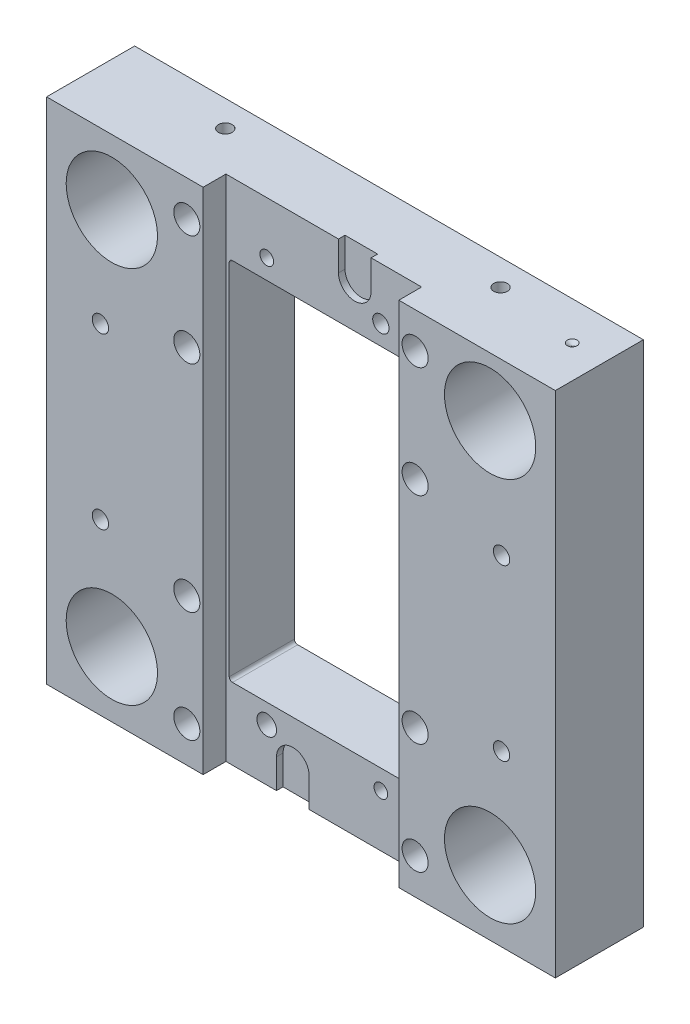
ISO-10303-21;
HEADER;
FILE_DESCRIPTION(('STEP AP214'),'2;1');
FILE_NAME('part.step','',(''),(''),'','','');
FILE_SCHEMA(('AUTOMOTIVE_DESIGN { 1 0 10303 214 1 1 1 1 }'));
ENDSEC;
DATA;
#1=APPLICATION_CONTEXT('core data for automotive mechanical design processes');
#2=APPLICATION_PROTOCOL_DEFINITION('international standard','automotive_design',2000,#1);
#3=PRODUCT_CONTEXT('',#1,'mechanical');
#4=PRODUCT('Part','Part','',(#3));
#5=PRODUCT_RELATED_PRODUCT_CATEGORY('part','',(#4));
#6=PRODUCT_DEFINITION_FORMATION('','',#4);
#7=PRODUCT_DEFINITION_CONTEXT('part definition',#1,'design');
#8=PRODUCT_DEFINITION('design','',#6,#7);
#9=PRODUCT_DEFINITION_SHAPE('','',#8);
#10=(LENGTH_UNIT() NAMED_UNIT(*) SI_UNIT(.MILLI.,.METRE.));
#11=(NAMED_UNIT(*) PLANE_ANGLE_UNIT() SI_UNIT($,.RADIAN.));
#12=(NAMED_UNIT(*) SI_UNIT($,.STERADIAN.) SOLID_ANGLE_UNIT());
#13=UNCERTAINTY_MEASURE_WITH_UNIT(LENGTH_MEASURE(1.E-05),#10,'distance_accuracy_value','');
#14=(GEOMETRIC_REPRESENTATION_CONTEXT(3) GLOBAL_UNCERTAINTY_ASSIGNED_CONTEXT((#13)) GLOBAL_UNIT_ASSIGNED_CONTEXT((#10,
#11,#12)) REPRESENTATION_CONTEXT('',''));
#15=CARTESIAN_POINT('',(0.,0.,0.));
#16=DIRECTION('',(0.,0.,1.));
#17=DIRECTION('',(1.,0.,0.));
#18=AXIS2_PLACEMENT_3D('',#15,#16,#17);
#19=CARTESIAN_POINT('',(30.,-78.,0.));
#20=DIRECTION('',(0.,0.,1.));
#21=DIRECTION('',(1.,0.,0.));
#22=AXIS2_PLACEMENT_3D('',#19,#20,#21);
#23=PLANE('',#22);
#24=CARTESIAN_POINT('',(61.5,26.,0.));
#25=DIRECTION('',(0.,0.,-1.));
#26=DIRECTION('',(-1.,0.,0.));
#27=AXIS2_PLACEMENT_3D('',#24,#25,#26);
#28=CIRCLE('',#27,2.5);
#29=CARTESIAN_POINT('',(59.,26.,0.));
#30=VERTEX_POINT('',#29);
#31=EDGE_CURVE('E304',#30,#30,#28,.T.);
#32=ORIENTED_EDGE('',*,*,#31,.T.);
#33=EDGE_LOOP('',(#32));
#34=FACE_BOUND('',#33,.T.);
#35=CARTESIAN_POINT('',(35.,-33.,0.));
#36=DIRECTION('',(0.,0.,-1.));
#37=DIRECTION('',(-1.,0.,0.));
#38=AXIS2_PLACEMENT_3D('',#35,#36,#37);
#39=CIRCLE('',#38,4.);
#40=CARTESIAN_POINT('',(31.,-33.,0.));
#41=VERTEX_POINT('',#40);
#42=EDGE_CURVE('E391',#41,#41,#39,.T.);
#43=ORIENTED_EDGE('',*,*,#42,.T.);
#44=EDGE_LOOP('',(#43));
#45=FACE_BOUND('',#44,.T.);
#46=CARTESIAN_POINT('',(35.,33.,0.));
#47=DIRECTION('',(0.,0.,-1.));
#48=DIRECTION('',(-1.,0.,0.));
#49=AXIS2_PLACEMENT_3D('',#46,#47,#48);
#50=CIRCLE('',#49,4.);
#51=CARTESIAN_POINT('',(31.,33.,0.));
#52=VERTEX_POINT('',#51);
#53=EDGE_CURVE('E397',#52,#52,#50,.T.);
#54=ORIENTED_EDGE('',*,*,#53,.T.);
#55=EDGE_LOOP('',(#54));
#56=FACE_BOUND('',#55,.T.);
#57=CARTESIAN_POINT('',(35.,-67.,0.));
#58=DIRECTION('',(0.,0.,-1.));
#59=DIRECTION('',(-1.,0.,0.));
#60=AXIS2_PLACEMENT_3D('',#57,#58,#59);
#61=CIRCLE('',#60,4.);
#62=CARTESIAN_POINT('',(31.,-67.,0.));
#63=VERTEX_POINT('',#62);
#64=EDGE_CURVE('E409',#63,#63,#61,.T.);
#65=ORIENTED_EDGE('',*,*,#64,.T.);
#66=EDGE_LOOP('',(#65));
#67=FACE_BOUND('',#66,.T.);
#68=CARTESIAN_POINT('',(35.,67.,0.));
#69=DIRECTION('',(0.,0.,-1.));
#70=DIRECTION('',(-1.,0.,0.));
#71=AXIS2_PLACEMENT_3D('',#68,#69,#70);
#72=CIRCLE('',#71,4.);
#73=CARTESIAN_POINT('',(31.,67.,0.));
#74=VERTEX_POINT('',#73);
#75=EDGE_CURVE('E421',#74,#74,#72,.T.);
#76=ORIENTED_EDGE('',*,*,#75,.T.);
#77=EDGE_LOOP('',(#76));
#78=FACE_BOUND('',#77,.T.);
#79=CARTESIAN_POINT('',(58.,-58.,0.));
#80=DIRECTION('',(0.,0.,-1.));
#81=DIRECTION('',(-1.,0.,0.));
#82=AXIS2_PLACEMENT_3D('',#79,#80,#81);
#83=CIRCLE('',#82,14.);
#84=CARTESIAN_POINT('',(44.,-58.,0.));
#85=VERTEX_POINT('',#84);
#86=EDGE_CURVE('E427',#85,#85,#83,.T.);
#87=ORIENTED_EDGE('',*,*,#86,.T.);
#88=EDGE_LOOP('',(#87));
#89=FACE_BOUND('',#88,.T.);
#90=CARTESIAN_POINT('',(58.,60.,0.));
#91=DIRECTION('',(0.,0.,-1.));
#92=DIRECTION('',(-1.,0.,0.));
#93=AXIS2_PLACEMENT_3D('',#90,#91,#92);
#94=CIRCLE('',#93,14.);
#95=CARTESIAN_POINT('',(44.,60.,0.));
#96=VERTEX_POINT('',#95);
#97=EDGE_CURVE('E445',#96,#96,#94,.T.);
#98=ORIENTED_EDGE('',*,*,#97,.T.);
#99=EDGE_LOOP('',(#98));
#100=FACE_BOUND('',#99,.T.);
#101=DIRECTION('',(0.,1.,0.));
#102=VECTOR('',#101,1.);
#103=CARTESIAN_POINT('',(78.,-78.,0.));
#104=LINE('',#103,#102);
#105=CARTESIAN_POINT('',(78.,-78.,0.));
#106=VERTEX_POINT('',#105);
#107=CARTESIAN_POINT('',(78.,78.,0.));
#108=VERTEX_POINT('',#107);
#109=EDGE_CURVE('E504',#106,#108,#104,.T.);
#110=ORIENTED_EDGE('',*,*,#109,.T.);
#111=DIRECTION('',(1.,0.,0.));
#112=VECTOR('',#111,1.);
#113=CARTESIAN_POINT('',(30.,78.,0.));
#114=LINE('',#113,#112);
#115=CARTESIAN_POINT('',(30.,78.,0.));
#116=VERTEX_POINT('',#115);
#117=EDGE_CURVE('E464',#116,#108,#114,.T.);
#118=ORIENTED_EDGE('',*,*,#117,.F.);
#119=DIRECTION('',(0.,1.,0.));
#120=VECTOR('',#119,1.);
#121=CARTESIAN_POINT('',(30.,-78.,0.));
#122=LINE('',#121,#120);
#123=CARTESIAN_POINT('',(30.,-78.,0.));
#124=VERTEX_POINT('',#123);
#125=EDGE_CURVE('E506',#124,#116,#122,.T.);
#126=ORIENTED_EDGE('',*,*,#125,.F.);
#127=DIRECTION('',(1.,0.,0.));
#128=VECTOR('',#127,1.);
#129=CARTESIAN_POINT('',(30.,-78.,0.));
#130=LINE('',#129,#128);
#131=EDGE_CURVE('E489',#124,#106,#130,.T.);
#132=ORIENTED_EDGE('',*,*,#131,.T.);
#133=EDGE_LOOP('',(#110,#118,#126,#132));
#134=FACE_BOUND('',#133,.T.);
#135=CARTESIAN_POINT('',(61.5,-26.,0.));
#136=DIRECTION('',(0.,0.,-1.));
#137=DIRECTION('',(-1.,0.,0.));
#138=AXIS2_PLACEMENT_3D('',#135,#136,#137);
#139=CIRCLE('',#138,2.5);
#140=CARTESIAN_POINT('',(59.,-26.,0.));
#141=VERTEX_POINT('',#140);
#142=EDGE_CURVE('E295',#141,#141,#139,.T.);
#143=ORIENTED_EDGE('',*,*,#142,.T.);
#144=EDGE_LOOP('',(#143));
#145=FACE_BOUND('',#144,.T.);
#146=ADVANCED_FACE('F36',(#34,#45,#56,#67,#78,#89,#100,#134,#145),#23,.T.);
#147=CARTESIAN_POINT('',(-78.,-78.,0.));
#148=DIRECTION('',(0.,0.,1.));
#149=DIRECTION('',(1.,0.,0.));
#150=AXIS2_PLACEMENT_3D('',#147,#148,#149);
#151=PLANE('',#150);
#152=CARTESIAN_POINT('',(-61.5,26.,0.));
#153=DIRECTION('',(0.,0.,-1.));
#154=DIRECTION('',(-1.,0.,0.));
#155=AXIS2_PLACEMENT_3D('',#152,#153,#154);
#156=CIRCLE('',#155,2.5);
#157=CARTESIAN_POINT('',(-64.,26.,0.));
#158=VERTEX_POINT('',#157);
#159=EDGE_CURVE('E310',#158,#158,#156,.T.);
#160=ORIENTED_EDGE('',*,*,#159,.T.);
#161=EDGE_LOOP('',(#160));
#162=FACE_BOUND('',#161,.T.);
#163=CARTESIAN_POINT('',(-35.,33.,0.));
#164=DIRECTION('',(0.,0.,-1.));
#165=DIRECTION('',(-1.,0.,0.));
#166=AXIS2_PLACEMENT_3D('',#163,#164,#165);
#167=CIRCLE('',#166,4.);
#168=CARTESIAN_POINT('',(-39.,33.,0.));
#169=VERTEX_POINT('',#168);
#170=EDGE_CURVE('E379',#169,#169,#167,.T.);
#171=ORIENTED_EDGE('',*,*,#170,.T.);
#172=EDGE_LOOP('',(#171));
#173=FACE_BOUND('',#172,.T.);
#174=CARTESIAN_POINT('',(-35.,-33.,0.));
#175=DIRECTION('',(0.,0.,-1.));
#176=DIRECTION('',(-1.,0.,0.));
#177=AXIS2_PLACEMENT_3D('',#174,#175,#176);
#178=CIRCLE('',#177,4.);
#179=CARTESIAN_POINT('',(-39.,-33.,0.));
#180=VERTEX_POINT('',#179);
#181=EDGE_CURVE('E385',#180,#180,#178,.T.);
#182=ORIENTED_EDGE('',*,*,#181,.T.);
#183=EDGE_LOOP('',(#182));
#184=FACE_BOUND('',#183,.T.);
#185=CARTESIAN_POINT('',(-35.,-67.,0.));
#186=DIRECTION('',(0.,0.,-1.));
#187=DIRECTION('',(-1.,0.,0.));
#188=AXIS2_PLACEMENT_3D('',#185,#186,#187);
#189=CIRCLE('',#188,4.);
#190=CARTESIAN_POINT('',(-39.,-67.,0.));
#191=VERTEX_POINT('',#190);
#192=EDGE_CURVE('E403',#191,#191,#189,.T.);
#193=ORIENTED_EDGE('',*,*,#192,.T.);
#194=EDGE_LOOP('',(#193));
#195=FACE_BOUND('',#194,.T.);
#196=CARTESIAN_POINT('',(-35.,67.,0.));
#197=DIRECTION('',(0.,0.,-1.));
#198=DIRECTION('',(-1.,0.,0.));
#199=AXIS2_PLACEMENT_3D('',#196,#197,#198);
#200=CIRCLE('',#199,4.);
#201=CARTESIAN_POINT('',(-39.,67.,0.));
#202=VERTEX_POINT('',#201);
#203=EDGE_CURVE('E415',#202,#202,#200,.T.);
#204=ORIENTED_EDGE('',*,*,#203,.T.);
#205=EDGE_LOOP('',(#204));
#206=FACE_BOUND('',#205,.T.);
#207=CARTESIAN_POINT('',(-58.,-58.,0.));
#208=DIRECTION('',(0.,0.,-1.));
#209=DIRECTION('',(-1.,0.,0.));
#210=AXIS2_PLACEMENT_3D('',#207,#208,#209);
#211=CIRCLE('',#210,14.);
#212=CARTESIAN_POINT('',(-72.,-58.,0.));
#213=VERTEX_POINT('',#212);
#214=EDGE_CURVE('E433',#213,#213,#211,.T.);
#215=ORIENTED_EDGE('',*,*,#214,.T.);
#216=EDGE_LOOP('',(#215));
#217=FACE_BOUND('',#216,.T.);
#218=CARTESIAN_POINT('',(-58.,58.,0.));
#219=DIRECTION('',(0.,0.,-1.));
#220=DIRECTION('',(-1.,0.,0.));
#221=AXIS2_PLACEMENT_3D('',#218,#219,#220);
#222=CIRCLE('',#221,14.);
#223=CARTESIAN_POINT('',(-72.,58.,0.));
#224=VERTEX_POINT('',#223);
#225=EDGE_CURVE('E439',#224,#224,#222,.T.);
#226=ORIENTED_EDGE('',*,*,#225,.T.);
#227=EDGE_LOOP('',(#226));
#228=FACE_BOUND('',#227,.T.);
#229=DIRECTION('',(0.,1.,0.));
#230=VECTOR('',#229,1.);
#231=CARTESIAN_POINT('',(-30.,-78.,0.));
#232=LINE('',#231,#230);
#233=CARTESIAN_POINT('',(-30.,-78.,0.));
#234=VERTEX_POINT('',#233);
#235=CARTESIAN_POINT('',(-30.,78.,0.));
#236=VERTEX_POINT('',#235);
#237=EDGE_CURVE('E513',#234,#236,#232,.T.);
#238=ORIENTED_EDGE('',*,*,#237,.T.);
#239=DIRECTION('',(1.,0.,0.));
#240=VECTOR('',#239,1.);
#241=CARTESIAN_POINT('',(-78.,78.,0.));
#242=LINE('',#241,#240);
#243=CARTESIAN_POINT('',(-78.,78.,0.));
#244=VERTEX_POINT('',#243);
#245=EDGE_CURVE('E451',#244,#236,#242,.T.);
#246=ORIENTED_EDGE('',*,*,#245,.F.);
#247=DIRECTION('',(0.,1.,0.));
#248=VECTOR('',#247,1.);
#249=CARTESIAN_POINT('',(-78.,-78.,0.));
#250=LINE('',#249,#248);
#251=CARTESIAN_POINT('',(-78.,-78.,0.));
#252=VERTEX_POINT('',#251);
#253=EDGE_CURVE('E498',#252,#244,#250,.T.);
#254=ORIENTED_EDGE('',*,*,#253,.F.);
#255=DIRECTION('',(1.,0.,0.));
#256=VECTOR('',#255,1.);
#257=CARTESIAN_POINT('',(-78.,-78.,0.));
#258=LINE('',#257,#256);
#259=EDGE_CURVE('E476',#252,#234,#258,.T.);
#260=ORIENTED_EDGE('',*,*,#259,.T.);
#261=EDGE_LOOP('',(#238,#246,#254,#260));
#262=FACE_BOUND('',#261,.T.);
#263=CARTESIAN_POINT('',(-61.5,-26.,0.));
#264=DIRECTION('',(0.,0.,-1.));
#265=DIRECTION('',(-1.,0.,0.));
#266=AXIS2_PLACEMENT_3D('',#263,#264,#265);
#267=CIRCLE('',#266,2.5);
#268=CARTESIAN_POINT('',(-64.,-26.,0.));
#269=VERTEX_POINT('',#268);
#270=EDGE_CURVE('E307',#269,#269,#267,.T.);
#271=ORIENTED_EDGE('',*,*,#270,.T.);
#272=EDGE_LOOP('',(#271));
#273=FACE_BOUND('',#272,.T.);
#274=ADVANCED_FACE('F581',(#162,#173,#184,#195,#206,#217,#228,#262,#273),#151,.T.);
#275=CARTESIAN_POINT('',(-78.,-78.,-27.));
#276=DIRECTION('',(-1.,0.,0.));
#277=DIRECTION('',(0.,0.,1.));
#278=AXIS2_PLACEMENT_3D('',#275,#276,#277);
#279=PLANE('',#278);
#280=ORIENTED_EDGE('',*,*,#253,.T.);
#281=DIRECTION('',(0.,0.,1.));
#282=VECTOR('',#281,1.);
#283=CARTESIAN_POINT('',(-78.,78.,-27.));
#284=LINE('',#283,#282);
#285=CARTESIAN_POINT('',(-78.,78.,-27.));
#286=VERTEX_POINT('',#285);
#287=EDGE_CURVE('E448',#286,#244,#284,.T.);
#288=ORIENTED_EDGE('',*,*,#287,.F.);
#289=DIRECTION('',(0.,1.,0.));
#290=VECTOR('',#289,1.);
#291=CARTESIAN_POINT('',(-78.,-78.,-27.));
#292=LINE('',#291,#290);
#293=CARTESIAN_POINT('',(-78.,-78.,-27.));
#294=VERTEX_POINT('',#293);
#295=EDGE_CURVE('E499',#294,#286,#292,.T.);
#296=ORIENTED_EDGE('',*,*,#295,.F.);
#297=DIRECTION('',(0.,0.,1.));
#298=VECTOR('',#297,1.);
#299=CARTESIAN_POINT('',(-78.,-78.,-27.));
#300=LINE('',#299,#298);
#301=EDGE_CURVE('E473',#294,#252,#300,.T.);
#302=ORIENTED_EDGE('',*,*,#301,.T.);
#303=EDGE_LOOP('',(#280,#288,#296,#302));
#304=FACE_BOUND('',#303,.T.);
#305=ADVANCED_FACE('F38',(#304),#279,.T.);
#306=CARTESIAN_POINT('',(78.,-78.,-27.));
#307=DIRECTION('',(0.,0.,-1.));
#308=DIRECTION('',(-1.,0.,0.));
#309=AXIS2_PLACEMENT_3D('',#306,#307,#308);
#310=PLANE('',#309);
#311=CARTESIAN_POINT('',(-61.5,26.,-27.));
#312=DIRECTION('',(0.,0.,-1.));
#313=DIRECTION('',(-1.,0.,0.));
#314=AXIS2_PLACEMENT_3D('',#311,#312,#313);
#315=CIRCLE('',#314,3.00000000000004);
#316=CARTESIAN_POINT('',(-64.5,26.,-27.));
#317=VERTEX_POINT('',#316);
#318=EDGE_CURVE('E552',#317,#317,#315,.F.);
#319=ORIENTED_EDGE('',*,*,#318,.T.);
#320=EDGE_LOOP('',(#319));
#321=FACE_BOUND('',#320,.T.);
#322=CARTESIAN_POINT('',(-61.5,-26.,-27.));
#323=DIRECTION('',(0.,0.,-1.));
#324=DIRECTION('',(-1.,0.,0.));
#325=AXIS2_PLACEMENT_3D('',#322,#323,#324);
#326=CIRCLE('',#325,2.99999999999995);
#327=CARTESIAN_POINT('',(-64.5,-26.,-27.));
#328=VERTEX_POINT('',#327);
#329=EDGE_CURVE('E549',#328,#328,#326,.F.);
#330=ORIENTED_EDGE('',*,*,#329,.T.);
#331=EDGE_LOOP('',(#330));
#332=FACE_BOUND('',#331,.T.);
#333=CARTESIAN_POINT('',(61.5,26.,-27.));
#334=DIRECTION('',(0.,0.,-1.));
#335=DIRECTION('',(-1.,0.,0.));
#336=AXIS2_PLACEMENT_3D('',#333,#334,#335);
#337=CIRCLE('',#336,3.00000000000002);
#338=CARTESIAN_POINT('',(58.5,26.,-27.));
#339=VERTEX_POINT('',#338);
#340=EDGE_CURVE('E546',#339,#339,#337,.F.);
#341=ORIENTED_EDGE('',*,*,#340,.T.);
#342=EDGE_LOOP('',(#341));
#343=FACE_BOUND('',#342,.T.);
#344=CARTESIAN_POINT('',(61.5,-26.,-27.));
#345=DIRECTION('',(0.,0.,-1.));
#346=DIRECTION('',(-1.,0.,0.));
#347=AXIS2_PLACEMENT_3D('',#344,#345,#346);
#348=CIRCLE('',#347,2.99999999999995);
#349=CARTESIAN_POINT('',(58.5,-26.,-27.));
#350=VERTEX_POINT('',#349);
#351=EDGE_CURVE('E543',#350,#350,#348,.F.);
#352=ORIENTED_EDGE('',*,*,#351,.T.);
#353=EDGE_LOOP('',(#352));
#354=FACE_BOUND('',#353,.T.);
#355=CARTESIAN_POINT('',(17.5000000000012,-62.0000000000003,-27.));
#356=DIRECTION('',(0.,0.,-1.));
#357=DIRECTION('',(-1.,0.,0.));
#358=AXIS2_PLACEMENT_3D('',#355,#356,#357);
#359=CIRCLE('',#358,2.09999999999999);
#360=CARTESIAN_POINT('',(15.4000000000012,-62.0000000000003,-27.));
#361=VERTEX_POINT('',#360);
#362=EDGE_CURVE('E313',#361,#361,#359,.T.);
#363=ORIENTED_EDGE('',*,*,#362,.F.);
#364=EDGE_LOOP('',(#363));
#365=FACE_BOUND('',#364,.T.);
#366=CARTESIAN_POINT('',(-17.4999999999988,61.9999999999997,-27.));
#367=DIRECTION('',(0.,0.,-1.));
#368=DIRECTION('',(-1.,0.,0.));
#369=AXIS2_PLACEMENT_3D('',#366,#367,#368);
#370=CIRCLE('',#369,2.09999999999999);
#371=CARTESIAN_POINT('',(-19.5999999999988,61.9999999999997,-27.));
#372=VERTEX_POINT('',#371);
#373=EDGE_CURVE('E317',#372,#372,#370,.T.);
#374=ORIENTED_EDGE('',*,*,#373,.F.);
#375=EDGE_LOOP('',(#374));
#376=FACE_BOUND('',#375,.T.);
#377=CARTESIAN_POINT('',(-17.4999999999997,-62.,-27.));
#378=DIRECTION('',(0.,0.,1.));
#379=DIRECTION('',(1.,0.,0.));
#380=AXIS2_PLACEMENT_3D('',#377,#378,#379);
#381=CIRCLE('',#380,3.00349999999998);
#382=CARTESIAN_POINT('',(-14.4964999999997,-62.,-27.));
#383=VERTEX_POINT('',#382);
#384=EDGE_CURVE('E321',#383,#383,#381,.T.);
#385=ORIENTED_EDGE('',*,*,#384,.T.);
#386=EDGE_LOOP('',(#385));
#387=FACE_BOUND('',#386,.T.);
#388=CARTESIAN_POINT('',(17.5000000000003,62.,-27.));
#389=DIRECTION('',(0.,0.,1.));
#390=DIRECTION('',(1.,0.,0.));
#391=AXIS2_PLACEMENT_3D('',#388,#389,#390);
#392=CIRCLE('',#391,2.50349999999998);
#393=CARTESIAN_POINT('',(20.0035000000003,62.,-27.));
#394=VERTEX_POINT('',#393);
#395=EDGE_CURVE('E325',#394,#394,#392,.T.);
#396=ORIENTED_EDGE('',*,*,#395,.T.);
#397=EDGE_LOOP('',(#396));
#398=FACE_BOUND('',#397,.T.);
#399=CARTESIAN_POINT('',(-28.,55.,-27.));
#400=DIRECTION('',(0.,0.,1.));
#401=DIRECTION('',(1.,0.,0.));
#402=AXIS2_PLACEMENT_3D('',#399,#400,#401);
#403=CIRCLE('',#402,1.);
#404=CARTESIAN_POINT('',(-28.,56.,-27.));
#405=VERTEX_POINT('',#404);
#406=CARTESIAN_POINT('',(-29.,55.,-27.));
#407=VERTEX_POINT('',#406);
#408=EDGE_CURVE('E329',#405,#407,#403,.T.);
#409=ORIENTED_EDGE('',*,*,#408,.T.);
#410=DIRECTION('',(0.,-1.,0.));
#411=VECTOR('',#410,1.);
#412=CARTESIAN_POINT('',(-29.,-55.,-27.));
#413=LINE('',#412,#411);
#414=CARTESIAN_POINT('',(-29.,-55.,-27.));
#415=VERTEX_POINT('',#414);
#416=EDGE_CURVE('E332',#407,#415,#413,.T.);
#417=ORIENTED_EDGE('',*,*,#416,.T.);
#418=CARTESIAN_POINT('',(-28.,-55.,-27.));
#419=DIRECTION('',(0.,0.,1.));
#420=DIRECTION('',(1.,0.,0.));
#421=AXIS2_PLACEMENT_3D('',#418,#419,#420);
#422=CIRCLE('',#421,1.);
#423=CARTESIAN_POINT('',(-28.,-56.,-27.));
#424=VERTEX_POINT('',#423);
#425=EDGE_CURVE('E335',#415,#424,#422,.T.);
#426=ORIENTED_EDGE('',*,*,#425,.T.);
#427=DIRECTION('',(1.,0.,0.));
#428=VECTOR('',#427,1.);
#429=CARTESIAN_POINT('',(28.,-56.,-27.));
#430=LINE('',#429,#428);
#431=CARTESIAN_POINT('',(28.,-56.,-27.));
#432=VERTEX_POINT('',#431);
#433=EDGE_CURVE('E338',#424,#432,#430,.T.);
#434=ORIENTED_EDGE('',*,*,#433,.T.);
#435=CARTESIAN_POINT('',(28.,-55.,-27.));
#436=DIRECTION('',(0.,0.,1.));
#437=DIRECTION('',(1.,0.,0.));
#438=AXIS2_PLACEMENT_3D('',#435,#436,#437);
#439=CIRCLE('',#438,1.);
#440=CARTESIAN_POINT('',(29.,-55.,-27.));
#441=VERTEX_POINT('',#440);
#442=EDGE_CURVE('E341',#432,#441,#439,.T.);
#443=ORIENTED_EDGE('',*,*,#442,.T.);
#444=DIRECTION('',(0.,1.,0.));
#445=VECTOR('',#444,1.);
#446=CARTESIAN_POINT('',(29.,-55.,-27.));
#447=LINE('',#446,#445);
#448=CARTESIAN_POINT('',(29.,55.,-27.));
#449=VERTEX_POINT('',#448);
#450=EDGE_CURVE('E344',#441,#449,#447,.T.);
#451=ORIENTED_EDGE('',*,*,#450,.T.);
#452=CARTESIAN_POINT('',(28.,55.,-27.));
#453=DIRECTION('',(0.,0.,1.));
#454=DIRECTION('',(1.,0.,0.));
#455=AXIS2_PLACEMENT_3D('',#452,#453,#454);
#456=CIRCLE('',#455,1.);
#457=CARTESIAN_POINT('',(28.,56.,-27.));
#458=VERTEX_POINT('',#457);
#459=EDGE_CURVE('E347',#449,#458,#456,.T.);
#460=ORIENTED_EDGE('',*,*,#459,.T.);
#461=DIRECTION('',(-1.,0.,0.));
#462=VECTOR('',#461,1.);
#463=CARTESIAN_POINT('',(28.,56.,-27.));
#464=LINE('',#463,#462);
#465=EDGE_CURVE('E350',#458,#405,#464,.T.);
#466=ORIENTED_EDGE('',*,*,#465,.T.);
#467=EDGE_LOOP('',(#409,#417,#426,#434,#443,#451,#460,#466));
#468=FACE_BOUND('',#467,.T.);
#469=CARTESIAN_POINT('',(-35.,33.,-27.));
#470=DIRECTION('',(0.,0.,-1.));
#471=DIRECTION('',(-1.,0.,0.));
#472=AXIS2_PLACEMENT_3D('',#469,#470,#471);
#473=CIRCLE('',#472,4.);
#474=CARTESIAN_POINT('',(-39.,33.,-27.));
#475=VERTEX_POINT('',#474);
#476=EDGE_CURVE('E357',#475,#475,#473,.T.);
#477=ORIENTED_EDGE('',*,*,#476,.F.);
#478=EDGE_LOOP('',(#477));
#479=FACE_BOUND('',#478,.T.);
#480=CARTESIAN_POINT('',(-35.,-33.,-27.));
#481=DIRECTION('',(0.,0.,-1.));
#482=DIRECTION('',(-1.,0.,0.));
#483=AXIS2_PLACEMENT_3D('',#480,#481,#482);
#484=CIRCLE('',#483,4.);
#485=CARTESIAN_POINT('',(-39.,-33.,-27.));
#486=VERTEX_POINT('',#485);
#487=EDGE_CURVE('E382',#486,#486,#484,.T.);
#488=ORIENTED_EDGE('',*,*,#487,.F.);
#489=EDGE_LOOP('',(#488));
#490=FACE_BOUND('',#489,.T.);
#491=CARTESIAN_POINT('',(35.,-33.,-27.));
#492=DIRECTION('',(0.,0.,-1.));
#493=DIRECTION('',(-1.,0.,0.));
#494=AXIS2_PLACEMENT_3D('',#491,#492,#493);
#495=CIRCLE('',#494,4.);
#496=CARTESIAN_POINT('',(31.,-33.,-27.));
#497=VERTEX_POINT('',#496);
#498=EDGE_CURVE('E388',#497,#497,#495,.T.);
#499=ORIENTED_EDGE('',*,*,#498,.F.);
#500=EDGE_LOOP('',(#499));
#501=FACE_BOUND('',#500,.T.);
#502=CARTESIAN_POINT('',(35.,33.,-27.));
#503=DIRECTION('',(0.,0.,-1.));
#504=DIRECTION('',(-1.,0.,0.));
#505=AXIS2_PLACEMENT_3D('',#502,#503,#504);
#506=CIRCLE('',#505,4.);
#507=CARTESIAN_POINT('',(31.,33.,-27.));
#508=VERTEX_POINT('',#507);
#509=EDGE_CURVE('E394',#508,#508,#506,.T.);
#510=ORIENTED_EDGE('',*,*,#509,.F.);
#511=EDGE_LOOP('',(#510));
#512=FACE_BOUND('',#511,.T.);
#513=CARTESIAN_POINT('',(-35.,-67.,-27.));
#514=DIRECTION('',(0.,0.,-1.));
#515=DIRECTION('',(-1.,0.,0.));
#516=AXIS2_PLACEMENT_3D('',#513,#514,#515);
#517=CIRCLE('',#516,4.);
#518=CARTESIAN_POINT('',(-39.,-67.,-27.));
#519=VERTEX_POINT('',#518);
#520=EDGE_CURVE('E400',#519,#519,#517,.T.);
#521=ORIENTED_EDGE('',*,*,#520,.F.);
#522=EDGE_LOOP('',(#521));
#523=FACE_BOUND('',#522,.T.);
#524=CARTESIAN_POINT('',(35.,-67.,-27.));
#525=DIRECTION('',(0.,0.,-1.));
#526=DIRECTION('',(-1.,0.,0.));
#527=AXIS2_PLACEMENT_3D('',#524,#525,#526);
#528=CIRCLE('',#527,4.);
#529=CARTESIAN_POINT('',(31.,-67.,-27.));
#530=VERTEX_POINT('',#529);
#531=EDGE_CURVE('E406',#530,#530,#528,.T.);
#532=ORIENTED_EDGE('',*,*,#531,.F.);
#533=EDGE_LOOP('',(#532));
#534=FACE_BOUND('',#533,.T.);
#535=CARTESIAN_POINT('',(-35.,67.,-27.));
#536=DIRECTION('',(0.,0.,-1.));
#537=DIRECTION('',(-1.,0.,0.));
#538=AXIS2_PLACEMENT_3D('',#535,#536,#537);
#539=CIRCLE('',#538,4.);
#540=CARTESIAN_POINT('',(-39.,67.,-27.));
#541=VERTEX_POINT('',#540);
#542=EDGE_CURVE('E412',#541,#541,#539,.T.);
#543=ORIENTED_EDGE('',*,*,#542,.F.);
#544=EDGE_LOOP('',(#543));
#545=FACE_BOUND('',#544,.T.);
#546=CARTESIAN_POINT('',(35.,67.,-27.));
#547=DIRECTION('',(0.,0.,-1.));
#548=DIRECTION('',(-1.,0.,0.));
#549=AXIS2_PLACEMENT_3D('',#546,#547,#548);
#550=CIRCLE('',#549,4.);
#551=CARTESIAN_POINT('',(31.,67.,-27.));
#552=VERTEX_POINT('',#551);
#553=EDGE_CURVE('E418',#552,#552,#550,.T.);
#554=ORIENTED_EDGE('',*,*,#553,.F.);
#555=EDGE_LOOP('',(#554));
#556=FACE_BOUND('',#555,.T.);
#557=CARTESIAN_POINT('',(58.,-58.,-27.));
#558=DIRECTION('',(0.,0.,-1.));
#559=DIRECTION('',(-1.,0.,0.));
#560=AXIS2_PLACEMENT_3D('',#557,#558,#559);
#561=CIRCLE('',#560,14.);
#562=CARTESIAN_POINT('',(44.,-58.,-27.));
#563=VERTEX_POINT('',#562);
#564=EDGE_CURVE('E424',#563,#563,#561,.T.);
#565=ORIENTED_EDGE('',*,*,#564,.F.);
#566=EDGE_LOOP('',(#565));
#567=FACE_BOUND('',#566,.T.);
#568=CARTESIAN_POINT('',(-58.,-58.,-27.));
#569=DIRECTION('',(0.,0.,-1.));
#570=DIRECTION('',(-1.,0.,0.));
#571=AXIS2_PLACEMENT_3D('',#568,#569,#570);
#572=CIRCLE('',#571,14.);
#573=CARTESIAN_POINT('',(-72.,-58.,-27.));
#574=VERTEX_POINT('',#573);
#575=EDGE_CURVE('E430',#574,#574,#572,.T.);
#576=ORIENTED_EDGE('',*,*,#575,.F.);
#577=EDGE_LOOP('',(#576));
#578=FACE_BOUND('',#577,.T.);
#579=CARTESIAN_POINT('',(-58.,58.,-27.));
#580=DIRECTION('',(0.,0.,-1.));
#581=DIRECTION('',(-1.,0.,0.));
#582=AXIS2_PLACEMENT_3D('',#579,#580,#581);
#583=CIRCLE('',#582,14.);
#584=CARTESIAN_POINT('',(-72.,58.,-27.));
#585=VERTEX_POINT('',#584);
#586=EDGE_CURVE('E436',#585,#585,#583,.T.);
#587=ORIENTED_EDGE('',*,*,#586,.F.);
#588=EDGE_LOOP('',(#587));
#589=FACE_BOUND('',#588,.T.);
#590=CARTESIAN_POINT('',(58.,60.,-27.));
#591=DIRECTION('',(0.,0.,-1.));
#592=DIRECTION('',(-1.,0.,0.));
#593=AXIS2_PLACEMENT_3D('',#590,#591,#592);
#594=CIRCLE('',#593,14.);
#595=CARTESIAN_POINT('',(44.,60.,-27.));
#596=VERTEX_POINT('',#595);
#597=EDGE_CURVE('E442',#596,#596,#594,.T.);
#598=ORIENTED_EDGE('',*,*,#597,.F.);
#599=EDGE_LOOP('',(#598));
#600=FACE_BOUND('',#599,.T.);
#601=ORIENTED_EDGE('',*,*,#295,.T.);
#602=DIRECTION('',(-1.,0.,0.));
#603=VECTOR('',#602,1.);
#604=CARTESIAN_POINT('',(78.,78.,-27.));
#605=LINE('',#604,#603);
#606=CARTESIAN_POINT('',(78.,78.,-27.));
#607=VERTEX_POINT('',#606);
#608=EDGE_CURVE('E470',#607,#286,#605,.T.);
#609=ORIENTED_EDGE('',*,*,#608,.F.);
#610=DIRECTION('',(0.,1.,0.));
#611=VECTOR('',#610,1.);
#612=CARTESIAN_POINT('',(78.,-78.,-27.));
#613=LINE('',#612,#611);
#614=CARTESIAN_POINT('',(78.,-78.,-27.));
#615=VERTEX_POINT('',#614);
#616=EDGE_CURVE('E502',#615,#607,#613,.T.);
#617=ORIENTED_EDGE('',*,*,#616,.F.);
#618=DIRECTION('',(-1.,0.,0.));
#619=VECTOR('',#618,1.);
#620=CARTESIAN_POINT('',(78.,-78.,-27.));
#621=LINE('',#620,#619);
#622=EDGE_CURVE('E495',#615,#294,#621,.T.);
#623=ORIENTED_EDGE('',*,*,#622,.T.);
#624=EDGE_LOOP('',(#601,#609,#617,#623));
#625=FACE_BOUND('',#624,.T.);
#626=ADVANCED_FACE('F649',(#321,#332,#343,#354,#365,#376,#387,#398,#468,#479,#490,#501,#512,
#523,#534,#545,#556,#567,#578,#589,#600,#625),#310,.T.);
#627=CARTESIAN_POINT('',(78.,-78.,0.));
#628=DIRECTION('',(1.,0.,0.));
#629=DIRECTION('',(0.,0.,-1.));
#630=AXIS2_PLACEMENT_3D('',#627,#628,#629);
#631=PLANE('',#630);
#632=ORIENTED_EDGE('',*,*,#616,.T.);
#633=DIRECTION('',(0.,0.,-1.));
#634=VECTOR('',#633,1.);
#635=CARTESIAN_POINT('',(78.,78.,0.));
#636=LINE('',#635,#634);
#637=EDGE_CURVE('E467',#108,#607,#636,.T.);
#638=ORIENTED_EDGE('',*,*,#637,.F.);
#639=ORIENTED_EDGE('',*,*,#109,.F.);
#640=DIRECTION('',(0.,0.,-1.));
#641=VECTOR('',#640,1.);
#642=CARTESIAN_POINT('',(78.,-78.,0.));
#643=LINE('',#642,#641);
#644=EDGE_CURVE('E492',#106,#615,#643,.T.);
#645=ORIENTED_EDGE('',*,*,#644,.T.);
#646=EDGE_LOOP('',(#632,#638,#639,#645));
#647=FACE_BOUND('',#646,.T.);
#648=ADVANCED_FACE('F591',(#647),#631,.T.);
#649=CARTESIAN_POINT('',(30.,-78.,-7.));
#650=DIRECTION('',(-1.,0.,0.));
#651=DIRECTION('',(0.,0.,1.));
#652=AXIS2_PLACEMENT_3D('',#649,#650,#651);
#653=PLANE('',#652);
#654=ORIENTED_EDGE('',*,*,#125,.T.);
#655=DIRECTION('',(0.,0.,1.));
#656=VECTOR('',#655,1.);
#657=CARTESIAN_POINT('',(30.,78.,-7.));
#658=LINE('',#657,#656);
#659=CARTESIAN_POINT('',(30.,78.,-7.));
#660=VERTEX_POINT('',#659);
#661=EDGE_CURVE('E461',#660,#116,#658,.T.);
#662=ORIENTED_EDGE('',*,*,#661,.F.);
#663=DIRECTION('',(0.,1.,0.));
#664=VECTOR('',#663,1.);
#665=CARTESIAN_POINT('',(30.,-78.,-7.));
#666=LINE('',#665,#664);
#667=CARTESIAN_POINT('',(30.,-78.,-7.));
#668=VERTEX_POINT('',#667);
#669=EDGE_CURVE('E508',#668,#660,#666,.T.);
#670=ORIENTED_EDGE('',*,*,#669,.F.);
#671=DIRECTION('',(0.,0.,1.));
#672=VECTOR('',#671,1.);
#673=CARTESIAN_POINT('',(30.,-78.,-7.));
#674=LINE('',#673,#672);
#675=EDGE_CURVE('E486',#668,#124,#674,.T.);
#676=ORIENTED_EDGE('',*,*,#675,.T.);
#677=EDGE_LOOP('',(#654,#662,#670,#676));
#678=FACE_BOUND('',#677,.T.);
#679=ADVANCED_FACE('F593',(#678),#653,.T.);
#680=CARTESIAN_POINT('',(-30.,-78.,-7.));
#681=DIRECTION('',(0.,0.,1.));
#682=DIRECTION('',(1.,0.,0.));
#683=AXIS2_PLACEMENT_3D('',#680,#681,#682);
#684=PLANE('',#683);
#685=DIRECTION('',(0.,-1.,0.));
#686=VECTOR('',#685,1.);
#687=CARTESIAN_POINT('',(-14.4999999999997,-69.,-7.));
#688=LINE('',#687,#686);
#689=CARTESIAN_POINT('',(-14.4999999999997,-69.,-7.));
#690=VERTEX_POINT('',#689);
#691=CARTESIAN_POINT('',(-14.4999999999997,-78.,-7.));
#692=VERTEX_POINT('',#691);
#693=EDGE_CURVE('E257',#690,#692,#688,.T.);
#694=ORIENTED_EDGE('',*,*,#693,.F.);
#695=CARTESIAN_POINT('',(-9.49999999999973,-69.,-7.));
#696=DIRECTION('',(0.,0.,1.));
#697=DIRECTION('',(1.,0.,0.));
#698=AXIS2_PLACEMENT_3D('',#695,#696,#697);
#699=CIRCLE('',#698,5.);
#700=CARTESIAN_POINT('',(-4.49999999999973,-69.,-7.));
#701=VERTEX_POINT('',#700);
#702=EDGE_CURVE('E254',#701,#690,#699,.T.);
#703=ORIENTED_EDGE('',*,*,#702,.F.);
#704=DIRECTION('',(0.,1.,0.));
#705=VECTOR('',#704,1.);
#706=CARTESIAN_POINT('',(-4.49999999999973,-69.,-7.));
#707=LINE('',#706,#705);
#708=CARTESIAN_POINT('',(-4.49999999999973,-78.,-7.));
#709=VERTEX_POINT('',#708);
#710=EDGE_CURVE('E251',#709,#701,#707,.T.);
#711=ORIENTED_EDGE('',*,*,#710,.F.);
#712=DIRECTION('',(1.,0.,0.));
#713=VECTOR('',#712,1.);
#714=CARTESIAN_POINT('',(-30.,-78.,-7.));
#715=LINE('',#714,#713);
#716=EDGE_CURVE('E482',#709,#668,#715,.T.);
#717=ORIENTED_EDGE('',*,*,#716,.T.);
#718=ORIENTED_EDGE('',*,*,#669,.T.);
#719=DIRECTION('',(1.,0.,0.));
#720=VECTOR('',#719,1.);
#721=CARTESIAN_POINT('',(-30.,78.,-7.));
#722=LINE('',#721,#720);
#723=CARTESIAN_POINT('',(14.5000000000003,78.,-7.));
#724=VERTEX_POINT('',#723);
#725=EDGE_CURVE('E457',#724,#660,#722,.T.);
#726=ORIENTED_EDGE('',*,*,#725,.F.);
#727=DIRECTION('',(0.,1.,0.));
#728=VECTOR('',#727,1.);
#729=CARTESIAN_POINT('',(14.5000000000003,78.,-7.));
#730=LINE('',#729,#728);
#731=CARTESIAN_POINT('',(14.5000000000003,69.,-7.));
#732=VERTEX_POINT('',#731);
#733=EDGE_CURVE('E279',#732,#724,#730,.T.);
#734=ORIENTED_EDGE('',*,*,#733,.F.);
#735=CARTESIAN_POINT('',(9.50000000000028,69.,-7.));
#736=DIRECTION('',(0.,0.,1.));
#737=DIRECTION('',(1.,0.,0.));
#738=AXIS2_PLACEMENT_3D('',#735,#736,#737);
#739=CIRCLE('',#738,5.);
#740=CARTESIAN_POINT('',(4.50000000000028,69.,-7.));
#741=VERTEX_POINT('',#740);
#742=EDGE_CURVE('E271',#741,#732,#739,.T.);
#743=ORIENTED_EDGE('',*,*,#742,.F.);
#744=DIRECTION('',(0.,-1.,0.));
#745=VECTOR('',#744,1.);
#746=CARTESIAN_POINT('',(4.50000000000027,78.,-7.));
#747=LINE('',#746,#745);
#748=CARTESIAN_POINT('',(4.50000000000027,78.,-7.));
#749=VERTEX_POINT('',#748);
#750=EDGE_CURVE('E281',#749,#741,#747,.T.);
#751=ORIENTED_EDGE('',*,*,#750,.F.);
#752=CARTESIAN_POINT('',(-30.,78.,-7.));
#753=VERTEX_POINT('',#752);
#754=EDGE_CURVE('E458',#753,#749,#722,.T.);
#755=ORIENTED_EDGE('',*,*,#754,.F.);
#756=DIRECTION('',(0.,1.,0.));
#757=VECTOR('',#756,1.);
#758=CARTESIAN_POINT('',(-30.,-78.,-7.));
#759=LINE('',#758,#757);
#760=CARTESIAN_POINT('',(-30.,-78.,-7.));
#761=VERTEX_POINT('',#760);
#762=EDGE_CURVE('E511',#761,#753,#759,.T.);
#763=ORIENTED_EDGE('',*,*,#762,.F.);
#764=EDGE_CURVE('E483',#761,#692,#715,.T.);
#765=ORIENTED_EDGE('',*,*,#764,.T.);
#766=EDGE_LOOP('',(#694,#703,#711,#717,#718,#726,#734,#743,#751,#755,#763,#765));
#767=FACE_BOUND('',#766,.T.);
#768=CARTESIAN_POINT('',(17.5000000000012,-62.0000000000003,-7.));
#769=DIRECTION('',(0.,0.,1.));
#770=DIRECTION('',(1.,0.,0.));
#771=AXIS2_PLACEMENT_3D('',#768,#769,#770);
#772=CIRCLE('',#771,2.09999999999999);
#773=CARTESIAN_POINT('',(19.6000000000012,-62.0000000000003,-7.));
#774=VERTEX_POINT('',#773);
#775=EDGE_CURVE('E316',#774,#774,#772,.T.);
#776=ORIENTED_EDGE('',*,*,#775,.F.);
#777=EDGE_LOOP('',(#776));
#778=FACE_BOUND('',#777,.T.);
#779=CARTESIAN_POINT('',(-17.4999999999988,61.9999999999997,-7.));
#780=DIRECTION('',(0.,0.,1.));
#781=DIRECTION('',(1.,0.,0.));
#782=AXIS2_PLACEMENT_3D('',#779,#780,#781);
#783=CIRCLE('',#782,2.09999999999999);
#784=CARTESIAN_POINT('',(-15.3999999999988,61.9999999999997,-7.));
#785=VERTEX_POINT('',#784);
#786=EDGE_CURVE('E320',#785,#785,#783,.T.);
#787=ORIENTED_EDGE('',*,*,#786,.F.);
#788=EDGE_LOOP('',(#787));
#789=FACE_BOUND('',#788,.T.);
#790=CARTESIAN_POINT('',(-17.4999999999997,-62.,-7.));
#791=DIRECTION('',(0.,0.,1.));
#792=DIRECTION('',(1.,0.,0.));
#793=AXIS2_PLACEMENT_3D('',#790,#791,#792);
#794=CIRCLE('',#793,3.00349999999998);
#795=CARTESIAN_POINT('',(-14.4964999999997,-62.,-7.));
#796=VERTEX_POINT('',#795);
#797=EDGE_CURVE('E324',#796,#796,#794,.T.);
#798=ORIENTED_EDGE('',*,*,#797,.F.);
#799=EDGE_LOOP('',(#798));
#800=FACE_BOUND('',#799,.T.);
#801=CARTESIAN_POINT('',(17.5000000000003,62.,-7.));
#802=DIRECTION('',(0.,0.,1.));
#803=DIRECTION('',(1.,0.,0.));
#804=AXIS2_PLACEMENT_3D('',#801,#802,#803);
#805=CIRCLE('',#804,2.50349999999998);
#806=CARTESIAN_POINT('',(20.0035000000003,62.,-7.));
#807=VERTEX_POINT('',#806);
#808=EDGE_CURVE('E328',#807,#807,#805,.T.);
#809=ORIENTED_EDGE('',*,*,#808,.F.);
#810=EDGE_LOOP('',(#809));
#811=FACE_BOUND('',#810,.T.);
#812=CARTESIAN_POINT('',(-28.,55.,-7.));
#813=DIRECTION('',(0.,0.,1.));
#814=DIRECTION('',(1.,0.,0.));
#815=AXIS2_PLACEMENT_3D('',#812,#813,#814);
#816=CIRCLE('',#815,1.);
#817=CARTESIAN_POINT('',(-28.,56.,-7.));
#818=VERTEX_POINT('',#817);
#819=CARTESIAN_POINT('',(-29.,55.,-7.));
#820=VERTEX_POINT('',#819);
#821=EDGE_CURVE('E529',#818,#820,#816,.T.);
#822=ORIENTED_EDGE('',*,*,#821,.F.);
#823=DIRECTION('',(-1.,0.,0.));
#824=VECTOR('',#823,1.);
#825=CARTESIAN_POINT('',(-30.,56.,-7.));
#826=LINE('',#825,#824);
#827=CARTESIAN_POINT('',(28.,56.,-7.));
#828=VERTEX_POINT('',#827);
#829=EDGE_CURVE('E527',#828,#818,#826,.T.);
#830=ORIENTED_EDGE('',*,*,#829,.F.);
#831=CARTESIAN_POINT('',(28.,55.,-7.));
#832=DIRECTION('',(0.,0.,1.));
#833=DIRECTION('',(1.,0.,0.));
#834=AXIS2_PLACEMENT_3D('',#831,#832,#833);
#835=CIRCLE('',#834,1.);
#836=CARTESIAN_POINT('',(29.,55.,-7.));
#837=VERTEX_POINT('',#836);
#838=EDGE_CURVE('E525',#837,#828,#835,.T.);
#839=ORIENTED_EDGE('',*,*,#838,.F.);
#840=DIRECTION('',(0.,1.,0.));
#841=VECTOR('',#840,1.);
#842=CARTESIAN_POINT('',(29.,-78.,-7.));
#843=LINE('',#842,#841);
#844=CARTESIAN_POINT('',(29.,-55.,-7.));
#845=VERTEX_POINT('',#844);
#846=EDGE_CURVE('E523',#845,#837,#843,.T.);
#847=ORIENTED_EDGE('',*,*,#846,.F.);
#848=CARTESIAN_POINT('',(28.,-55.,-7.));
#849=DIRECTION('',(0.,0.,1.));
#850=DIRECTION('',(1.,0.,0.));
#851=AXIS2_PLACEMENT_3D('',#848,#849,#850);
#852=CIRCLE('',#851,1.);
#853=CARTESIAN_POINT('',(28.,-56.,-7.));
#854=VERTEX_POINT('',#853);
#855=EDGE_CURVE('E521',#854,#845,#852,.T.);
#856=ORIENTED_EDGE('',*,*,#855,.F.);
#857=DIRECTION('',(1.,0.,0.));
#858=VECTOR('',#857,1.);
#859=CARTESIAN_POINT('',(-30.,-56.,-7.));
#860=LINE('',#859,#858);
#861=CARTESIAN_POINT('',(-28.,-56.,-7.));
#862=VERTEX_POINT('',#861);
#863=EDGE_CURVE('E519',#862,#854,#860,.T.);
#864=ORIENTED_EDGE('',*,*,#863,.F.);
#865=CARTESIAN_POINT('',(-28.,-55.,-7.));
#866=DIRECTION('',(0.,0.,1.));
#867=DIRECTION('',(1.,0.,0.));
#868=AXIS2_PLACEMENT_3D('',#865,#866,#867);
#869=CIRCLE('',#868,1.);
#870=CARTESIAN_POINT('',(-29.,-55.,-7.));
#871=VERTEX_POINT('',#870);
#872=EDGE_CURVE('E517',#871,#862,#869,.T.);
#873=ORIENTED_EDGE('',*,*,#872,.F.);
#874=DIRECTION('',(0.,-1.,0.));
#875=VECTOR('',#874,1.);
#876=CARTESIAN_POINT('',(-29.,-78.,-7.));
#877=LINE('',#876,#875);
#878=EDGE_CURVE('E501',#820,#871,#877,.T.);
#879=ORIENTED_EDGE('',*,*,#878,.F.);
#880=EDGE_LOOP('',(#822,#830,#839,#847,#856,#864,#873,#879));
#881=FACE_BOUND('',#880,.T.);
#882=ADVANCED_FACE('F596',(#767,#778,#789,#800,#811,#881),#684,.T.);
#883=CARTESIAN_POINT('',(-30.,-78.,0.));
#884=DIRECTION('',(1.,0.,0.));
#885=DIRECTION('',(0.,0.,-1.));
#886=AXIS2_PLACEMENT_3D('',#883,#884,#885);
#887=PLANE('',#886);
#888=ORIENTED_EDGE('',*,*,#762,.T.);
#889=DIRECTION('',(0.,0.,-1.));
#890=VECTOR('',#889,1.);
#891=CARTESIAN_POINT('',(-30.,78.,0.));
#892=LINE('',#891,#890);
#893=EDGE_CURVE('E454',#236,#753,#892,.T.);
#894=ORIENTED_EDGE('',*,*,#893,.F.);
#895=ORIENTED_EDGE('',*,*,#237,.F.);
#896=DIRECTION('',(0.,0.,-1.));
#897=VECTOR('',#896,1.);
#898=CARTESIAN_POINT('',(-30.,-78.,0.));
#899=LINE('',#898,#897);
#900=EDGE_CURVE('E479',#234,#761,#899,.T.);
#901=ORIENTED_EDGE('',*,*,#900,.T.);
#902=EDGE_LOOP('',(#888,#894,#895,#901));
#903=FACE_BOUND('',#902,.T.);
#904=ADVANCED_FACE('F600',(#903),#887,.T.);
#905=CARTESIAN_POINT('',(-78.,-78.,0.));
#906=DIRECTION('',(0.,1.,0.));
#907=DIRECTION('',(0.,0.,1.));
#908=AXIS2_PLACEMENT_3D('',#905,#906,#907);
#909=PLANE('',#908);
#910=CARTESIAN_POINT('',(42.2,-78.,-19.));
#911=DIRECTION('',(0.,-1.,0.));
#912=DIRECTION('',(0.,0.,-1.));
#913=AXIS2_PLACEMENT_3D('',#910,#911,#912);
#914=CIRCLE('',#913,2.1);
#915=CARTESIAN_POINT('',(42.2,-78.,-21.1));
#916=VERTEX_POINT('',#915);
#917=EDGE_CURVE('E242',#916,#916,#914,.T.);
#918=ORIENTED_EDGE('',*,*,#917,.F.);
#919=EDGE_LOOP('',(#918));
#920=FACE_BOUND('',#919,.T.);
#921=CARTESIAN_POINT('',(-42.2,-78.,-19.));
#922=DIRECTION('',(0.,-1.,0.));
#923=DIRECTION('',(0.,0.,-1.));
#924=AXIS2_PLACEMENT_3D('',#921,#922,#923);
#925=CIRCLE('',#924,2.1);
#926=CARTESIAN_POINT('',(-42.2,-78.,-21.1));
#927=VERTEX_POINT('',#926);
#928=EDGE_CURVE('E248',#927,#927,#925,.T.);
#929=ORIENTED_EDGE('',*,*,#928,.F.);
#930=EDGE_LOOP('',(#929));
#931=FACE_BOUND('',#930,.T.);
#932=DIRECTION('',(1.,0.,0.));
#933=VECTOR('',#932,1.);
#934=CARTESIAN_POINT('',(-14.4999999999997,-78.,-9.));
#935=LINE('',#934,#933);
#936=CARTESIAN_POINT('',(-14.4999999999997,-78.,-9.));
#937=VERTEX_POINT('',#936);
#938=CARTESIAN_POINT('',(-4.49999999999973,-78.,-9.));
#939=VERTEX_POINT('',#938);
#940=EDGE_CURVE('E259',#937,#939,#935,.T.);
#941=ORIENTED_EDGE('',*,*,#940,.F.);
#942=DIRECTION('',(0.,0.,1.));
#943=VECTOR('',#942,1.);
#944=CARTESIAN_POINT('',(-14.4999999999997,-78.,-9.));
#945=LINE('',#944,#943);
#946=EDGE_CURVE('E268',#937,#692,#945,.T.);
#947=ORIENTED_EDGE('',*,*,#946,.T.);
#948=ORIENTED_EDGE('',*,*,#764,.F.);
#949=ORIENTED_EDGE('',*,*,#900,.F.);
#950=ORIENTED_EDGE('',*,*,#259,.F.);
#951=ORIENTED_EDGE('',*,*,#301,.F.);
#952=ORIENTED_EDGE('',*,*,#622,.F.);
#953=ORIENTED_EDGE('',*,*,#644,.F.);
#954=ORIENTED_EDGE('',*,*,#131,.F.);
#955=ORIENTED_EDGE('',*,*,#675,.F.);
#956=ORIENTED_EDGE('',*,*,#716,.F.);
#957=DIRECTION('',(0.,0.,1.));
#958=VECTOR('',#957,1.);
#959=CARTESIAN_POINT('',(-4.49999999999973,-78.,-9.));
#960=LINE('',#959,#958);
#961=EDGE_CURVE('E267',#939,#709,#960,.T.);
#962=ORIENTED_EDGE('',*,*,#961,.F.);
#963=EDGE_LOOP('',(#941,#947,#948,#949,#950,#951,#952,#953,#954,#955,#956,#962));
#964=FACE_BOUND('',#963,.T.);
#965=ADVANCED_FACE('F603',(#920,#931,#964),#909,.F.);
#966=CARTESIAN_POINT('',(-78.,78.,0.));
#967=DIRECTION('',(0.,1.,0.));
#968=DIRECTION('',(0.,0.,1.));
#969=AXIS2_PLACEMENT_3D('',#966,#967,#968);
#970=PLANE('',#969);
#971=CARTESIAN_POINT('',(67.9370159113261,78.,-15.2292381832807));
#972=DIRECTION('',(0.,1.,0.));
#973=DIRECTION('',(0.,0.,1.));
#974=AXIS2_PLACEMENT_3D('',#971,#972,#973);
#975=CIRCLE('',#974,1.49999999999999);
#976=CARTESIAN_POINT('',(67.9370159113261,78.,-13.7292381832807));
#977=VERTEX_POINT('',#976);
#978=EDGE_CURVE('E222',#977,#977,#975,.T.);
#979=ORIENTED_EDGE('',*,*,#978,.F.);
#980=EDGE_LOOP('',(#979));
#981=FACE_BOUND('',#980,.T.);
#982=CARTESIAN_POINT('',(42.2,78.,-19.));
#983=DIRECTION('',(0.,1.,0.));
#984=DIRECTION('',(0.,0.,1.));
#985=AXIS2_PLACEMENT_3D('',#982,#983,#984);
#986=CIRCLE('',#985,2.09999999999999);
#987=CARTESIAN_POINT('',(42.2,78.,-16.9));
#988=VERTEX_POINT('',#987);
#989=EDGE_CURVE('E230',#988,#988,#986,.T.);
#990=ORIENTED_EDGE('',*,*,#989,.F.);
#991=EDGE_LOOP('',(#990));
#992=FACE_BOUND('',#991,.T.);
#993=CARTESIAN_POINT('',(-42.2,78.,-19.));
#994=DIRECTION('',(0.,1.,0.));
#995=DIRECTION('',(0.,0.,1.));
#996=AXIS2_PLACEMENT_3D('',#993,#994,#995);
#997=CIRCLE('',#996,2.09999999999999);
#998=CARTESIAN_POINT('',(-42.2,78.,-16.9));
#999=VERTEX_POINT('',#998);
#1000=EDGE_CURVE('E236',#999,#999,#997,.T.);
#1001=ORIENTED_EDGE('',*,*,#1000,.F.);
#1002=EDGE_LOOP('',(#1001));
#1003=FACE_BOUND('',#1002,.T.);
#1004=DIRECTION('',(0.,0.,1.));
#1005=VECTOR('',#1004,1.);
#1006=CARTESIAN_POINT('',(4.50000000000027,78.,-9.));
#1007=LINE('',#1006,#1005);
#1008=CARTESIAN_POINT('',(4.50000000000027,78.,-9.));
#1009=VERTEX_POINT('',#1008);
#1010=EDGE_CURVE('E296',#1009,#749,#1007,.T.);
#1011=ORIENTED_EDGE('',*,*,#1010,.F.);
#1012=DIRECTION('',(-1.,0.,0.));
#1013=VECTOR('',#1012,1.);
#1014=CARTESIAN_POINT('',(4.50000000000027,78.,-9.));
#1015=LINE('',#1014,#1013);
#1016=CARTESIAN_POINT('',(14.5000000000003,78.,-9.));
#1017=VERTEX_POINT('',#1016);
#1018=EDGE_CURVE('E287',#1017,#1009,#1015,.T.);
#1019=ORIENTED_EDGE('',*,*,#1018,.F.);
#1020=DIRECTION('',(0.,0.,1.));
#1021=VECTOR('',#1020,1.);
#1022=CARTESIAN_POINT('',(14.5000000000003,78.,-9.));
#1023=LINE('',#1022,#1021);
#1024=EDGE_CURVE('E298',#1017,#724,#1023,.T.);
#1025=ORIENTED_EDGE('',*,*,#1024,.T.);
#1026=ORIENTED_EDGE('',*,*,#725,.T.);
#1027=ORIENTED_EDGE('',*,*,#661,.T.);
#1028=ORIENTED_EDGE('',*,*,#117,.T.);
#1029=ORIENTED_EDGE('',*,*,#637,.T.);
#1030=ORIENTED_EDGE('',*,*,#608,.T.);
#1031=ORIENTED_EDGE('',*,*,#287,.T.);
#1032=ORIENTED_EDGE('',*,*,#245,.T.);
#1033=ORIENTED_EDGE('',*,*,#893,.T.);
#1034=ORIENTED_EDGE('',*,*,#754,.T.);
#1035=EDGE_LOOP('',(#1011,#1019,#1025,#1026,#1027,#1028,#1029,#1030,#1031,#1032,#1033,#1034));
#1036=FACE_BOUND('',#1035,.T.);
#1037=ADVANCED_FACE('F608',(#981,#992,#1003,#1036),#970,.T.);
#1038=CARTESIAN_POINT('',(58.,60.,0.));
#1039=DIRECTION('',(0.,0.,-1.));
#1040=DIRECTION('',(-1.,0.,0.));
#1041=AXIS2_PLACEMENT_3D('',#1038,#1039,#1040);
#1042=CYLINDRICAL_SURFACE('',#1041,14.);
#1043=ORIENTED_EDGE('',*,*,#97,.F.);
#1044=EDGE_LOOP('',(#1043));
#1045=FACE_BOUND('',#1044,.T.);
#1046=ORIENTED_EDGE('',*,*,#597,.T.);
#1047=EDGE_LOOP('',(#1046));
#1048=FACE_BOUND('',#1047,.T.);
#1049=ADVANCED_FACE('F825',(#1045,#1048),#1042,.F.);
#1050=CARTESIAN_POINT('',(-58.,58.,0.));
#1051=DIRECTION('',(0.,0.,-1.));
#1052=DIRECTION('',(-1.,0.,0.));
#1053=AXIS2_PLACEMENT_3D('',#1050,#1051,#1052);
#1054=CYLINDRICAL_SURFACE('',#1053,14.);
#1055=ORIENTED_EDGE('',*,*,#225,.F.);
#1056=EDGE_LOOP('',(#1055));
#1057=FACE_BOUND('',#1056,.T.);
#1058=ORIENTED_EDGE('',*,*,#586,.T.);
#1059=EDGE_LOOP('',(#1058));
#1060=FACE_BOUND('',#1059,.T.);
#1061=ADVANCED_FACE('F855',(#1057,#1060),#1054,.F.);
#1062=CARTESIAN_POINT('',(-58.,-58.,0.));
#1063=DIRECTION('',(0.,0.,-1.));
#1064=DIRECTION('',(-1.,0.,0.));
#1065=AXIS2_PLACEMENT_3D('',#1062,#1063,#1064);
#1066=CYLINDRICAL_SURFACE('',#1065,14.);
#1067=ORIENTED_EDGE('',*,*,#214,.F.);
#1068=EDGE_LOOP('',(#1067));
#1069=FACE_BOUND('',#1068,.T.);
#1070=ORIENTED_EDGE('',*,*,#575,.T.);
#1071=EDGE_LOOP('',(#1070));
#1072=FACE_BOUND('',#1071,.T.);
#1073=ADVANCED_FACE('F862',(#1069,#1072),#1066,.F.);
#1074=CARTESIAN_POINT('',(58.,-58.,0.));
#1075=DIRECTION('',(0.,0.,-1.));
#1076=DIRECTION('',(-1.,0.,0.));
#1077=AXIS2_PLACEMENT_3D('',#1074,#1075,#1076);
#1078=CYLINDRICAL_SURFACE('',#1077,14.);
#1079=ORIENTED_EDGE('',*,*,#86,.F.);
#1080=EDGE_LOOP('',(#1079));
#1081=FACE_BOUND('',#1080,.T.);
#1082=ORIENTED_EDGE('',*,*,#564,.T.);
#1083=EDGE_LOOP('',(#1082));
#1084=FACE_BOUND('',#1083,.T.);
#1085=ADVANCED_FACE('F870',(#1081,#1084),#1078,.F.);
#1086=CARTESIAN_POINT('',(35.,67.,0.));
#1087=DIRECTION('',(0.,0.,-1.));
#1088=DIRECTION('',(-1.,0.,0.));
#1089=AXIS2_PLACEMENT_3D('',#1086,#1087,#1088);
#1090=CYLINDRICAL_SURFACE('',#1089,4.);
#1091=ORIENTED_EDGE('',*,*,#75,.F.);
#1092=EDGE_LOOP('',(#1091));
#1093=FACE_BOUND('',#1092,.T.);
#1094=ORIENTED_EDGE('',*,*,#553,.T.);
#1095=EDGE_LOOP('',(#1094));
#1096=FACE_BOUND('',#1095,.T.);
#1097=ADVANCED_FACE('F878',(#1093,#1096),#1090,.F.);
#1098=CARTESIAN_POINT('',(-35.,67.,0.));
#1099=DIRECTION('',(0.,0.,-1.));
#1100=DIRECTION('',(-1.,0.,0.));
#1101=AXIS2_PLACEMENT_3D('',#1098,#1099,#1100);
#1102=CYLINDRICAL_SURFACE('',#1101,4.);
#1103=ORIENTED_EDGE('',*,*,#203,.F.);
#1104=EDGE_LOOP('',(#1103));
#1105=FACE_BOUND('',#1104,.T.);
#1106=ORIENTED_EDGE('',*,*,#542,.T.);
#1107=EDGE_LOOP('',(#1106));
#1108=FACE_BOUND('',#1107,.T.);
#1109=ADVANCED_FACE('F886',(#1105,#1108),#1102,.F.);
#1110=CARTESIAN_POINT('',(35.,-67.,0.));
#1111=DIRECTION('',(0.,0.,-1.));
#1112=DIRECTION('',(-1.,0.,0.));
#1113=AXIS2_PLACEMENT_3D('',#1110,#1111,#1112);
#1114=CYLINDRICAL_SURFACE('',#1113,4.);
#1115=ORIENTED_EDGE('',*,*,#64,.F.);
#1116=EDGE_LOOP('',(#1115));
#1117=FACE_BOUND('',#1116,.T.);
#1118=ORIENTED_EDGE('',*,*,#531,.T.);
#1119=EDGE_LOOP('',(#1118));
#1120=FACE_BOUND('',#1119,.T.);
#1121=ADVANCED_FACE('F894',(#1117,#1120),#1114,.F.);
#1122=CARTESIAN_POINT('',(-35.,-67.,0.));
#1123=DIRECTION('',(0.,0.,-1.));
#1124=DIRECTION('',(-1.,0.,0.));
#1125=AXIS2_PLACEMENT_3D('',#1122,#1123,#1124);
#1126=CYLINDRICAL_SURFACE('',#1125,4.);
#1127=ORIENTED_EDGE('',*,*,#192,.F.);
#1128=EDGE_LOOP('',(#1127));
#1129=FACE_BOUND('',#1128,.T.);
#1130=ORIENTED_EDGE('',*,*,#520,.T.);
#1131=EDGE_LOOP('',(#1130));
#1132=FACE_BOUND('',#1131,.T.);
#1133=ADVANCED_FACE('F902',(#1129,#1132),#1126,.F.);
#1134=CARTESIAN_POINT('',(35.,33.,0.));
#1135=DIRECTION('',(0.,0.,-1.));
#1136=DIRECTION('',(-1.,0.,0.));
#1137=AXIS2_PLACEMENT_3D('',#1134,#1135,#1136);
#1138=CYLINDRICAL_SURFACE('',#1137,4.);
#1139=ORIENTED_EDGE('',*,*,#53,.F.);
#1140=EDGE_LOOP('',(#1139));
#1141=FACE_BOUND('',#1140,.T.);
#1142=ORIENTED_EDGE('',*,*,#509,.T.);
#1143=EDGE_LOOP('',(#1142));
#1144=FACE_BOUND('',#1143,.T.);
#1145=ADVANCED_FACE('F910',(#1141,#1144),#1138,.F.);
#1146=CARTESIAN_POINT('',(35.,-33.,0.));
#1147=DIRECTION('',(0.,0.,-1.));
#1148=DIRECTION('',(-1.,0.,0.));
#1149=AXIS2_PLACEMENT_3D('',#1146,#1147,#1148);
#1150=CYLINDRICAL_SURFACE('',#1149,4.);
#1151=ORIENTED_EDGE('',*,*,#42,.F.);
#1152=EDGE_LOOP('',(#1151));
#1153=FACE_BOUND('',#1152,.T.);
#1154=ORIENTED_EDGE('',*,*,#498,.T.);
#1155=EDGE_LOOP('',(#1154));
#1156=FACE_BOUND('',#1155,.T.);
#1157=ADVANCED_FACE('F918',(#1153,#1156),#1150,.F.);
#1158=CARTESIAN_POINT('',(-35.,-33.,0.));
#1159=DIRECTION('',(0.,0.,-1.));
#1160=DIRECTION('',(-1.,0.,0.));
#1161=AXIS2_PLACEMENT_3D('',#1158,#1159,#1160);
#1162=CYLINDRICAL_SURFACE('',#1161,4.);
#1163=ORIENTED_EDGE('',*,*,#181,.F.);
#1164=EDGE_LOOP('',(#1163));
#1165=FACE_BOUND('',#1164,.T.);
#1166=ORIENTED_EDGE('',*,*,#487,.T.);
#1167=EDGE_LOOP('',(#1166));
#1168=FACE_BOUND('',#1167,.T.);
#1169=ADVANCED_FACE('F926',(#1165,#1168),#1162,.F.);
#1170=CARTESIAN_POINT('',(-35.,33.,0.));
#1171=DIRECTION('',(0.,0.,-1.));
#1172=DIRECTION('',(-1.,0.,0.));
#1173=AXIS2_PLACEMENT_3D('',#1170,#1171,#1172);
#1174=CYLINDRICAL_SURFACE('',#1173,4.);
#1175=ORIENTED_EDGE('',*,*,#170,.F.);
#1176=EDGE_LOOP('',(#1175));
#1177=FACE_BOUND('',#1176,.T.);
#1178=ORIENTED_EDGE('',*,*,#476,.T.);
#1179=EDGE_LOOP('',(#1178));
#1180=FACE_BOUND('',#1179,.T.);
#1181=ADVANCED_FACE('F934',(#1177,#1180),#1174,.F.);
#1182=CARTESIAN_POINT('',(-28.,55.,-27.));
#1183=DIRECTION('',(0.,0.,1.));
#1184=DIRECTION('',(1.,0.,0.));
#1185=AXIS2_PLACEMENT_3D('',#1182,#1183,#1184);
#1186=CYLINDRICAL_SURFACE('',#1185,1.);
#1187=ORIENTED_EDGE('',*,*,#821,.T.);
#1188=DIRECTION('',(0.,0.,1.));
#1189=VECTOR('',#1188,1.);
#1190=CARTESIAN_POINT('',(-29.,55.,-27.));
#1191=LINE('',#1190,#1189);
#1192=EDGE_CURVE('E353',#407,#820,#1191,.T.);
#1193=ORIENTED_EDGE('',*,*,#1192,.F.);
#1194=ORIENTED_EDGE('',*,*,#408,.F.);
#1195=DIRECTION('',(0.,0.,1.));
#1196=VECTOR('',#1195,1.);
#1197=CARTESIAN_POINT('',(-28.,56.,-27.));
#1198=LINE('',#1197,#1196);
#1199=EDGE_CURVE('E354',#405,#818,#1198,.T.);
#1200=ORIENTED_EDGE('',*,*,#1199,.T.);
#1201=EDGE_LOOP('',(#1187,#1193,#1194,#1200));
#1202=FACE_BOUND('',#1201,.T.);
#1203=ADVANCED_FACE('F942',(#1202),#1186,.F.);
#1204=CARTESIAN_POINT('',(28.,56.,-27.));
#1205=DIRECTION('',(0.,1.,0.));
#1206=DIRECTION('',(0.,0.,1.));
#1207=AXIS2_PLACEMENT_3D('',#1204,#1205,#1206);
#1208=PLANE('',#1207);
#1209=ORIENTED_EDGE('',*,*,#829,.T.);
#1210=ORIENTED_EDGE('',*,*,#1199,.F.);
#1211=ORIENTED_EDGE('',*,*,#465,.F.);
#1212=DIRECTION('',(0.,0.,1.));
#1213=VECTOR('',#1212,1.);
#1214=CARTESIAN_POINT('',(28.,56.,-27.));
#1215=LINE('',#1214,#1213);
#1216=EDGE_CURVE('E358',#458,#828,#1215,.T.);
#1217=ORIENTED_EDGE('',*,*,#1216,.T.);
#1218=EDGE_LOOP('',(#1209,#1210,#1211,#1217));
#1219=FACE_BOUND('',#1218,.T.);
#1220=ADVANCED_FACE('F950',(#1219),#1208,.F.);
#1221=CARTESIAN_POINT('',(28.,55.,-27.));
#1222=DIRECTION('',(0.,0.,1.));
#1223=DIRECTION('',(1.,0.,0.));
#1224=AXIS2_PLACEMENT_3D('',#1221,#1222,#1223);
#1225=CYLINDRICAL_SURFACE('',#1224,1.);
#1226=ORIENTED_EDGE('',*,*,#838,.T.);
#1227=ORIENTED_EDGE('',*,*,#1216,.F.);
#1228=ORIENTED_EDGE('',*,*,#459,.F.);
#1229=DIRECTION('',(0.,0.,1.));
#1230=VECTOR('',#1229,1.);
#1231=CARTESIAN_POINT('',(29.,55.,-27.));
#1232=LINE('',#1231,#1230);
#1233=EDGE_CURVE('E361',#449,#837,#1232,.T.);
#1234=ORIENTED_EDGE('',*,*,#1233,.T.);
#1235=EDGE_LOOP('',(#1226,#1227,#1228,#1234));
#1236=FACE_BOUND('',#1235,.T.);
#1237=ADVANCED_FACE('F958',(#1236),#1225,.F.);
#1238=CARTESIAN_POINT('',(29.,-55.,-27.));
#1239=DIRECTION('',(1.,0.,0.));
#1240=DIRECTION('',(0.,0.,-1.));
#1241=AXIS2_PLACEMENT_3D('',#1238,#1239,#1240);
#1242=PLANE('',#1241);
#1243=ORIENTED_EDGE('',*,*,#846,.T.);
#1244=ORIENTED_EDGE('',*,*,#1233,.F.);
#1245=ORIENTED_EDGE('',*,*,#450,.F.);
#1246=DIRECTION('',(0.,0.,1.));
#1247=VECTOR('',#1246,1.);
#1248=CARTESIAN_POINT('',(29.,-55.,-27.));
#1249=LINE('',#1248,#1247);
#1250=EDGE_CURVE('E364',#441,#845,#1249,.T.);
#1251=ORIENTED_EDGE('',*,*,#1250,.T.);
#1252=EDGE_LOOP('',(#1243,#1244,#1245,#1251));
#1253=FACE_BOUND('',#1252,.T.);
#1254=ADVANCED_FACE('F966',(#1253),#1242,.F.);
#1255=CARTESIAN_POINT('',(28.,-55.,-27.));
#1256=DIRECTION('',(0.,0.,1.));
#1257=DIRECTION('',(1.,0.,0.));
#1258=AXIS2_PLACEMENT_3D('',#1255,#1256,#1257);
#1259=CYLINDRICAL_SURFACE('',#1258,1.);
#1260=ORIENTED_EDGE('',*,*,#855,.T.);
#1261=ORIENTED_EDGE('',*,*,#1250,.F.);
#1262=ORIENTED_EDGE('',*,*,#442,.F.);
#1263=DIRECTION('',(0.,0.,1.));
#1264=VECTOR('',#1263,1.);
#1265=CARTESIAN_POINT('',(28.,-56.,-27.));
#1266=LINE('',#1265,#1264);
#1267=EDGE_CURVE('E367',#432,#854,#1266,.T.);
#1268=ORIENTED_EDGE('',*,*,#1267,.T.);
#1269=EDGE_LOOP('',(#1260,#1261,#1262,#1268));
#1270=FACE_BOUND('',#1269,.T.);
#1271=ADVANCED_FACE('F974',(#1270),#1259,.F.);
#1272=CARTESIAN_POINT('',(28.,-56.,-27.));
#1273=DIRECTION('',(0.,-1.,0.));
#1274=DIRECTION('',(0.,0.,-1.));
#1275=AXIS2_PLACEMENT_3D('',#1272,#1273,#1274);
#1276=PLANE('',#1275);
#1277=ORIENTED_EDGE('',*,*,#863,.T.);
#1278=ORIENTED_EDGE('',*,*,#1267,.F.);
#1279=ORIENTED_EDGE('',*,*,#433,.F.);
#1280=DIRECTION('',(0.,0.,1.));
#1281=VECTOR('',#1280,1.);
#1282=CARTESIAN_POINT('',(-28.,-56.,-27.));
#1283=LINE('',#1282,#1281);
#1284=EDGE_CURVE('E370',#424,#862,#1283,.T.);
#1285=ORIENTED_EDGE('',*,*,#1284,.T.);
#1286=EDGE_LOOP('',(#1277,#1278,#1279,#1285));
#1287=FACE_BOUND('',#1286,.T.);
#1288=ADVANCED_FACE('F982',(#1287),#1276,.F.);
#1289=CARTESIAN_POINT('',(-28.,-55.,-27.));
#1290=DIRECTION('',(0.,0.,1.));
#1291=DIRECTION('',(1.,0.,0.));
#1292=AXIS2_PLACEMENT_3D('',#1289,#1290,#1291);
#1293=CYLINDRICAL_SURFACE('',#1292,1.);
#1294=ORIENTED_EDGE('',*,*,#872,.T.);
#1295=ORIENTED_EDGE('',*,*,#1284,.F.);
#1296=ORIENTED_EDGE('',*,*,#425,.F.);
#1297=DIRECTION('',(0.,0.,1.));
#1298=VECTOR('',#1297,1.);
#1299=CARTESIAN_POINT('',(-29.,-55.,-27.));
#1300=LINE('',#1299,#1298);
#1301=EDGE_CURVE('E373',#415,#871,#1300,.T.);
#1302=ORIENTED_EDGE('',*,*,#1301,.T.);
#1303=EDGE_LOOP('',(#1294,#1295,#1296,#1302));
#1304=FACE_BOUND('',#1303,.T.);
#1305=ADVANCED_FACE('F990',(#1304),#1293,.F.);
#1306=CARTESIAN_POINT('',(-29.,-55.,-27.));
#1307=DIRECTION('',(-1.,0.,0.));
#1308=DIRECTION('',(0.,0.,1.));
#1309=AXIS2_PLACEMENT_3D('',#1306,#1307,#1308);
#1310=PLANE('',#1309);
#1311=ORIENTED_EDGE('',*,*,#878,.T.);
#1312=ORIENTED_EDGE('',*,*,#1301,.F.);
#1313=ORIENTED_EDGE('',*,*,#416,.F.);
#1314=ORIENTED_EDGE('',*,*,#1192,.T.);
#1315=EDGE_LOOP('',(#1311,#1312,#1313,#1314));
#1316=FACE_BOUND('',#1315,.T.);
#1317=ADVANCED_FACE('F998',(#1316),#1310,.F.);
#1318=CARTESIAN_POINT('',(17.5000000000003,62.,-27.));
#1319=DIRECTION('',(0.,0.,1.));
#1320=DIRECTION('',(1.,0.,0.));
#1321=AXIS2_PLACEMENT_3D('',#1318,#1319,#1320);
#1322=CYLINDRICAL_SURFACE('',#1321,2.50349999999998);
#1323=ORIENTED_EDGE('',*,*,#808,.T.);
#1324=EDGE_LOOP('',(#1323));
#1325=FACE_BOUND('',#1324,.T.);
#1326=ORIENTED_EDGE('',*,*,#395,.F.);
#1327=EDGE_LOOP('',(#1326));
#1328=FACE_BOUND('',#1327,.T.);
#1329=ADVANCED_FACE('F1006',(#1325,#1328),#1322,.F.);
#1330=CARTESIAN_POINT('',(-17.4999999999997,-62.,-27.));
#1331=DIRECTION('',(0.,0.,1.));
#1332=DIRECTION('',(1.,0.,0.));
#1333=AXIS2_PLACEMENT_3D('',#1330,#1331,#1332);
#1334=CYLINDRICAL_SURFACE('',#1333,3.00349999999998);
#1335=ORIENTED_EDGE('',*,*,#797,.T.);
#1336=EDGE_LOOP('',(#1335));
#1337=FACE_BOUND('',#1336,.T.);
#1338=ORIENTED_EDGE('',*,*,#384,.F.);
#1339=EDGE_LOOP('',(#1338));
#1340=FACE_BOUND('',#1339,.T.);
#1341=ADVANCED_FACE('F1014',(#1337,#1340),#1334,.F.);
#1342=CARTESIAN_POINT('',(-17.4999999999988,61.9999999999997,-27.));
#1343=DIRECTION('',(0.,0.,-1.));
#1344=DIRECTION('',(-1.,0.,0.));
#1345=AXIS2_PLACEMENT_3D('',#1342,#1343,#1344);
#1346=CYLINDRICAL_SURFACE('',#1345,2.09999999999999);
#1347=ORIENTED_EDGE('',*,*,#786,.T.);
#1348=EDGE_LOOP('',(#1347));
#1349=FACE_BOUND('',#1348,.T.);
#1350=ORIENTED_EDGE('',*,*,#373,.T.);
#1351=EDGE_LOOP('',(#1350));
#1352=FACE_BOUND('',#1351,.T.);
#1353=ADVANCED_FACE('F1022',(#1349,#1352),#1346,.F.);
#1354=CARTESIAN_POINT('',(17.5000000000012,-62.0000000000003,-27.));
#1355=DIRECTION('',(0.,0.,-1.));
#1356=DIRECTION('',(-1.,0.,0.));
#1357=AXIS2_PLACEMENT_3D('',#1354,#1355,#1356);
#1358=CYLINDRICAL_SURFACE('',#1357,2.09999999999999);
#1359=ORIENTED_EDGE('',*,*,#775,.T.);
#1360=EDGE_LOOP('',(#1359));
#1361=FACE_BOUND('',#1360,.T.);
#1362=ORIENTED_EDGE('',*,*,#362,.T.);
#1363=EDGE_LOOP('',(#1362));
#1364=FACE_BOUND('',#1363,.T.);
#1365=ADVANCED_FACE('F1030',(#1361,#1364),#1358,.F.);
#1366=CARTESIAN_POINT('',(-61.5,26.,-27.));
#1367=DIRECTION('',(0.,0.,-1.));
#1368=DIRECTION('',(-1.,0.,0.));
#1369=AXIS2_PLACEMENT_3D('',#1366,#1367,#1368);
#1370=CYLINDRICAL_SURFACE('',#1369,2.49999999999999);
#1371=CARTESIAN_POINT('',(-61.5,26.,-26.5));
#1372=DIRECTION('',(0.,0.,-1.));
#1373=DIRECTION('',(-1.,0.,0.));
#1374=AXIS2_PLACEMENT_3D('',#1371,#1372,#1373);
#1375=CIRCLE('',#1374,2.49999999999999);
#1376=CARTESIAN_POINT('',(-64.,26.,-26.5));
#1377=VERTEX_POINT('',#1376);
#1378=EDGE_CURVE('E532',#1377,#1377,#1375,.T.);
#1379=ORIENTED_EDGE('',*,*,#1378,.T.);
#1380=EDGE_LOOP('',(#1379));
#1381=FACE_BOUND('',#1380,.T.);
#1382=ORIENTED_EDGE('',*,*,#159,.F.);
#1383=EDGE_LOOP('',(#1382));
#1384=FACE_BOUND('',#1383,.T.);
#1385=ADVANCED_FACE('F1037',(#1381,#1384),#1370,.F.);
#1386=CARTESIAN_POINT('',(-61.5,-26.,-27.));
#1387=DIRECTION('',(0.,0.,-1.));
#1388=DIRECTION('',(-1.,0.,0.));
#1389=AXIS2_PLACEMENT_3D('',#1386,#1387,#1388);
#1390=CYLINDRICAL_SURFACE('',#1389,2.49999999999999);
#1391=CARTESIAN_POINT('',(-61.5,-26.,-26.5));
#1392=DIRECTION('',(0.,0.,-1.));
#1393=DIRECTION('',(-1.,0.,0.));
#1394=AXIS2_PLACEMENT_3D('',#1391,#1392,#1393);
#1395=CIRCLE('',#1394,2.49999999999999);
#1396=CARTESIAN_POINT('',(-64.,-26.,-26.5));
#1397=VERTEX_POINT('',#1396);
#1398=EDGE_CURVE('E555',#1397,#1397,#1395,.T.);
#1399=ORIENTED_EDGE('',*,*,#1398,.T.);
#1400=EDGE_LOOP('',(#1399));
#1401=FACE_BOUND('',#1400,.T.);
#1402=ORIENTED_EDGE('',*,*,#270,.F.);
#1403=EDGE_LOOP('',(#1402));
#1404=FACE_BOUND('',#1403,.T.);
#1405=ADVANCED_FACE('F1045',(#1401,#1404),#1390,.F.);
#1406=CARTESIAN_POINT('',(61.5,26.,-27.));
#1407=DIRECTION('',(0.,0.,-1.));
#1408=DIRECTION('',(-1.,0.,0.));
#1409=AXIS2_PLACEMENT_3D('',#1406,#1407,#1408);
#1410=CYLINDRICAL_SURFACE('',#1409,2.5);
#1411=CARTESIAN_POINT('',(61.5,26.,-26.5));
#1412=DIRECTION('',(0.,0.,-1.));
#1413=DIRECTION('',(-1.,0.,0.));
#1414=AXIS2_PLACEMENT_3D('',#1411,#1412,#1413);
#1415=CIRCLE('',#1414,2.5);
#1416=CARTESIAN_POINT('',(59.,26.,-26.5));
#1417=VERTEX_POINT('',#1416);
#1418=EDGE_CURVE('E44',#1417,#1417,#1415,.T.);
#1419=ORIENTED_EDGE('',*,*,#1418,.T.);
#1420=EDGE_LOOP('',(#1419));
#1421=FACE_BOUND('',#1420,.T.);
#1422=ORIENTED_EDGE('',*,*,#31,.F.);
#1423=EDGE_LOOP('',(#1422));
#1424=FACE_BOUND('',#1423,.T.);
#1425=ADVANCED_FACE('F560',(#1421,#1424),#1410,.F.);
#1426=CARTESIAN_POINT('',(61.5,-26.,-27.));
#1427=DIRECTION('',(0.,0.,-1.));
#1428=DIRECTION('',(-1.,0.,0.));
#1429=AXIS2_PLACEMENT_3D('',#1426,#1427,#1428);
#1430=CYLINDRICAL_SURFACE('',#1429,2.49999999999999);
#1431=CARTESIAN_POINT('',(61.5,-26.,-26.5));
#1432=DIRECTION('',(0.,0.,-1.));
#1433=DIRECTION('',(-1.,0.,0.));
#1434=AXIS2_PLACEMENT_3D('',#1431,#1432,#1433);
#1435=CIRCLE('',#1434,2.49999999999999);
#1436=CARTESIAN_POINT('',(59.,-26.,-26.5));
#1437=VERTEX_POINT('',#1436);
#1438=EDGE_CURVE('E11',#1437,#1437,#1435,.T.);
#1439=ORIENTED_EDGE('',*,*,#1438,.T.);
#1440=EDGE_LOOP('',(#1439));
#1441=FACE_BOUND('',#1440,.T.);
#1442=ORIENTED_EDGE('',*,*,#142,.F.);
#1443=EDGE_LOOP('',(#1442));
#1444=FACE_BOUND('',#1443,.T.);
#1445=ADVANCED_FACE('F1061',(#1441,#1444),#1430,.F.);
#1446=CARTESIAN_POINT('',(-61.5,26.,-26.5));
#1447=DIRECTION('',(0.,0.,-1.));
#1448=DIRECTION('',(-1.,0.,0.));
#1449=AXIS2_PLACEMENT_3D('',#1446,#1447,#1448);
#1450=CONICAL_SURFACE('',#1449,2.49999999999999,0.785398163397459);
#1451=ORIENTED_EDGE('',*,*,#318,.F.);
#1452=EDGE_LOOP('',(#1451));
#1453=FACE_BOUND('',#1452,.T.);
#1454=ORIENTED_EDGE('',*,*,#1378,.F.);
#1455=EDGE_LOOP('',(#1454));
#1456=FACE_BOUND('',#1455,.T.);
#1457=ADVANCED_FACE('F576',(#1453,#1456),#1450,.F.);
#1458=CARTESIAN_POINT('',(-61.5,-26.,-26.5));
#1459=DIRECTION('',(0.,0.,-1.));
#1460=DIRECTION('',(-1.,0.,0.));
#1461=AXIS2_PLACEMENT_3D('',#1458,#1459,#1460);
#1462=CONICAL_SURFACE('',#1461,2.49999999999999,0.785398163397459);
#1463=ORIENTED_EDGE('',*,*,#329,.F.);
#1464=EDGE_LOOP('',(#1463));
#1465=FACE_BOUND('',#1464,.T.);
#1466=ORIENTED_EDGE('',*,*,#1398,.F.);
#1467=EDGE_LOOP('',(#1466));
#1468=FACE_BOUND('',#1467,.T.);
#1469=ADVANCED_FACE('F566',(#1465,#1468),#1462,.F.);
#1470=CARTESIAN_POINT('',(61.5,26.,-26.5));
#1471=DIRECTION('',(0.,0.,-1.));
#1472=DIRECTION('',(-1.,0.,0.));
#1473=AXIS2_PLACEMENT_3D('',#1470,#1471,#1472);
#1474=CONICAL_SURFACE('',#1473,2.5,0.785398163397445);
#1475=ORIENTED_EDGE('',*,*,#340,.F.);
#1476=EDGE_LOOP('',(#1475));
#1477=FACE_BOUND('',#1476,.T.);
#1478=ORIENTED_EDGE('',*,*,#1418,.F.);
#1479=EDGE_LOOP('',(#1478));
#1480=FACE_BOUND('',#1479,.T.);
#1481=ADVANCED_FACE('F563',(#1477,#1480),#1474,.F.);
#1482=CARTESIAN_POINT('',(61.5,-26.,-26.5));
#1483=DIRECTION('',(0.,0.,-1.));
#1484=DIRECTION('',(-1.,0.,0.));
#1485=AXIS2_PLACEMENT_3D('',#1482,#1483,#1484);
#1486=CONICAL_SURFACE('',#1485,2.49999999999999,0.785398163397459);
#1487=ORIENTED_EDGE('',*,*,#351,.F.);
#1488=EDGE_LOOP('',(#1487));
#1489=FACE_BOUND('',#1488,.T.);
#1490=ORIENTED_EDGE('',*,*,#1438,.F.);
#1491=EDGE_LOOP('',(#1490));
#1492=FACE_BOUND('',#1491,.T.);
#1493=ADVANCED_FACE('F565',(#1489,#1492),#1486,.F.);
#1494=CARTESIAN_POINT('',(9.50000000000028,69.,-9.));
#1495=DIRECTION('',(0.,0.,1.));
#1496=DIRECTION('',(1.,0.,0.));
#1497=AXIS2_PLACEMENT_3D('',#1494,#1495,#1496);
#1498=CYLINDRICAL_SURFACE('',#1497,5.);
#1499=ORIENTED_EDGE('',*,*,#742,.T.);
#1500=DIRECTION('',(0.,0.,1.));
#1501=VECTOR('',#1500,1.);
#1502=CARTESIAN_POINT('',(14.5000000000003,69.,-9.));
#1503=LINE('',#1502,#1501);
#1504=CARTESIAN_POINT('',(14.5000000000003,69.,-9.));
#1505=VERTEX_POINT('',#1504);
#1506=EDGE_CURVE('E292',#1505,#732,#1503,.T.);
#1507=ORIENTED_EDGE('',*,*,#1506,.F.);
#1508=CARTESIAN_POINT('',(9.50000000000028,69.,-9.));
#1509=DIRECTION('',(0.,0.,1.));
#1510=DIRECTION('',(1.,0.,0.));
#1511=AXIS2_PLACEMENT_3D('',#1508,#1509,#1510);
#1512=CIRCLE('',#1511,5.);
#1513=CARTESIAN_POINT('',(4.50000000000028,69.,-9.));
#1514=VERTEX_POINT('',#1513);
#1515=EDGE_CURVE('E284',#1514,#1505,#1512,.T.);
#1516=ORIENTED_EDGE('',*,*,#1515,.F.);
#1517=DIRECTION('',(0.,0.,1.));
#1518=VECTOR('',#1517,1.);
#1519=CARTESIAN_POINT('',(4.50000000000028,69.,-9.));
#1520=LINE('',#1519,#1518);
#1521=EDGE_CURVE('E293',#1514,#741,#1520,.T.);
#1522=ORIENTED_EDGE('',*,*,#1521,.T.);
#1523=EDGE_LOOP('',(#1499,#1507,#1516,#1522));
#1524=FACE_BOUND('',#1523,.T.);
#1525=ADVANCED_FACE('F573',(#1524),#1498,.F.);
#1526=CARTESIAN_POINT('',(4.50000000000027,78.,-9.));
#1527=DIRECTION('',(-1.,0.,0.));
#1528=DIRECTION('',(0.,-1.,0.));
#1529=AXIS2_PLACEMENT_3D('',#1526,#1527,#1528);
#1530=PLANE('',#1529);
#1531=ORIENTED_EDGE('',*,*,#750,.T.);
#1532=ORIENTED_EDGE('',*,*,#1521,.F.);
#1533=DIRECTION('',(0.,-1.,0.));
#1534=VECTOR('',#1533,1.);
#1535=CARTESIAN_POINT('',(4.50000000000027,78.,-9.));
#1536=LINE('',#1535,#1534);
#1537=EDGE_CURVE('E289',#1009,#1514,#1536,.T.);
#1538=ORIENTED_EDGE('',*,*,#1537,.F.);
#1539=ORIENTED_EDGE('',*,*,#1010,.T.);
#1540=EDGE_LOOP('',(#1531,#1532,#1538,#1539));
#1541=FACE_BOUND('',#1540,.T.);
#1542=ADVANCED_FACE('F624',(#1541),#1530,.F.);
#1543=CARTESIAN_POINT('',(14.5000000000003,78.,-9.));
#1544=DIRECTION('',(1.,0.,0.));
#1545=DIRECTION('',(0.,1.,0.));
#1546=AXIS2_PLACEMENT_3D('',#1543,#1544,#1545);
#1547=PLANE('',#1546);
#1548=ORIENTED_EDGE('',*,*,#733,.T.);
#1549=ORIENTED_EDGE('',*,*,#1024,.F.);
#1550=DIRECTION('',(0.,1.,0.));
#1551=VECTOR('',#1550,1.);
#1552=CARTESIAN_POINT('',(14.5000000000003,78.,-9.));
#1553=LINE('',#1552,#1551);
#1554=EDGE_CURVE('E59',#1505,#1017,#1553,.T.);
#1555=ORIENTED_EDGE('',*,*,#1554,.F.);
#1556=ORIENTED_EDGE('',*,*,#1506,.T.);
#1557=EDGE_LOOP('',(#1548,#1549,#1555,#1556));
#1558=FACE_BOUND('',#1557,.T.);
#1559=ADVANCED_FACE('F632',(#1558),#1547,.F.);
#1560=CARTESIAN_POINT('',(9.50000000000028,69.,-9.));
#1561=DIRECTION('',(0.,0.,1.));
#1562=DIRECTION('',(1.,0.,0.));
#1563=AXIS2_PLACEMENT_3D('',#1560,#1561,#1562);
#1564=PLANE('',#1563);
#1565=ORIENTED_EDGE('',*,*,#1515,.T.);
#1566=ORIENTED_EDGE('',*,*,#1554,.T.);
#1567=ORIENTED_EDGE('',*,*,#1018,.T.);
#1568=ORIENTED_EDGE('',*,*,#1537,.T.);
#1569=EDGE_LOOP('',(#1565,#1566,#1567,#1568));
#1570=FACE_BOUND('',#1569,.T.);
#1571=ADVANCED_FACE('F629',(#1570),#1564,.T.);
#1572=CARTESIAN_POINT('',(-14.4999999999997,-69.,-9.));
#1573=DIRECTION('',(-1.,0.,0.));
#1574=DIRECTION('',(0.,0.,1.));
#1575=AXIS2_PLACEMENT_3D('',#1572,#1573,#1574);
#1576=PLANE('',#1575);
#1577=ORIENTED_EDGE('',*,*,#693,.T.);
#1578=ORIENTED_EDGE('',*,*,#946,.F.);
#1579=DIRECTION('',(0.,-1.,0.));
#1580=VECTOR('',#1579,1.);
#1581=CARTESIAN_POINT('',(-14.4999999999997,-69.,-9.));
#1582=LINE('',#1581,#1580);
#1583=CARTESIAN_POINT('',(-14.4999999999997,-69.,-9.));
#1584=VERTEX_POINT('',#1583);
#1585=EDGE_CURVE('E51',#1584,#937,#1582,.T.);
#1586=ORIENTED_EDGE('',*,*,#1585,.F.);
#1587=DIRECTION('',(0.,0.,1.));
#1588=VECTOR('',#1587,1.);
#1589=CARTESIAN_POINT('',(-14.4999999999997,-69.,-9.));
#1590=LINE('',#1589,#1588);
#1591=EDGE_CURVE('E272',#1584,#690,#1590,.T.);
#1592=ORIENTED_EDGE('',*,*,#1591,.T.);
#1593=EDGE_LOOP('',(#1577,#1578,#1586,#1592));
#1594=FACE_BOUND('',#1593,.T.);
#1595=ADVANCED_FACE('F658',(#1594),#1576,.F.);
#1596=CARTESIAN_POINT('',(-9.49999999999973,-69.,-9.));
#1597=DIRECTION('',(0.,0.,1.));
#1598=DIRECTION('',(1.,0.,0.));
#1599=AXIS2_PLACEMENT_3D('',#1596,#1597,#1598);
#1600=CYLINDRICAL_SURFACE('',#1599,5.);
#1601=ORIENTED_EDGE('',*,*,#702,.T.);
#1602=ORIENTED_EDGE('',*,*,#1591,.F.);
#1603=CARTESIAN_POINT('',(-9.49999999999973,-69.,-9.));
#1604=DIRECTION('',(0.,0.,1.));
#1605=DIRECTION('',(1.,0.,0.));
#1606=AXIS2_PLACEMENT_3D('',#1603,#1604,#1605);
#1607=CIRCLE('',#1606,5.);
#1608=CARTESIAN_POINT('',(-4.49999999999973,-69.,-9.));
#1609=VERTEX_POINT('',#1608);
#1610=EDGE_CURVE('E264',#1609,#1584,#1607,.T.);
#1611=ORIENTED_EDGE('',*,*,#1610,.F.);
#1612=DIRECTION('',(0.,0.,1.));
#1613=VECTOR('',#1612,1.);
#1614=CARTESIAN_POINT('',(-4.49999999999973,-69.,-9.));
#1615=LINE('',#1614,#1613);
#1616=EDGE_CURVE('E274',#1609,#701,#1615,.T.);
#1617=ORIENTED_EDGE('',*,*,#1616,.T.);
#1618=EDGE_LOOP('',(#1601,#1602,#1611,#1617));
#1619=FACE_BOUND('',#1618,.T.);
#1620=ADVANCED_FACE('F661',(#1619),#1600,.F.);
#1621=CARTESIAN_POINT('',(-4.49999999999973,-69.,-9.));
#1622=DIRECTION('',(1.,0.,0.));
#1623=DIRECTION('',(0.,1.,0.));
#1624=AXIS2_PLACEMENT_3D('',#1621,#1622,#1623);
#1625=PLANE('',#1624);
#1626=ORIENTED_EDGE('',*,*,#710,.T.);
#1627=ORIENTED_EDGE('',*,*,#1616,.F.);
#1628=DIRECTION('',(0.,1.,0.));
#1629=VECTOR('',#1628,1.);
#1630=CARTESIAN_POINT('',(-4.49999999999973,-69.,-9.));
#1631=LINE('',#1630,#1629);
#1632=EDGE_CURVE('E261',#939,#1609,#1631,.T.);
#1633=ORIENTED_EDGE('',*,*,#1632,.F.);
#1634=ORIENTED_EDGE('',*,*,#961,.T.);
#1635=EDGE_LOOP('',(#1626,#1627,#1633,#1634));
#1636=FACE_BOUND('',#1635,.T.);
#1637=ADVANCED_FACE('F663',(#1636),#1625,.F.);
#1638=CARTESIAN_POINT('',(-9.49999999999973,-69.,-9.));
#1639=DIRECTION('',(0.,0.,1.));
#1640=DIRECTION('',(1.,0.,0.));
#1641=AXIS2_PLACEMENT_3D('',#1638,#1639,#1640);
#1642=PLANE('',#1641);
#1643=ORIENTED_EDGE('',*,*,#940,.T.);
#1644=ORIENTED_EDGE('',*,*,#1632,.T.);
#1645=ORIENTED_EDGE('',*,*,#1610,.T.);
#1646=ORIENTED_EDGE('',*,*,#1585,.T.);
#1647=EDGE_LOOP('',(#1643,#1644,#1645,#1646));
#1648=FACE_BOUND('',#1647,.T.);
#1649=ADVANCED_FACE('F666',(#1648),#1642,.T.);
#1650=CARTESIAN_POINT('',(-42.2,-78.,-19.));
#1651=DIRECTION('',(0.,-1.,0.));
#1652=DIRECTION('',(0.,0.,-1.));
#1653=AXIS2_PLACEMENT_3D('',#1650,#1651,#1652);
#1654=CYLINDRICAL_SURFACE('',#1653,2.1);
#1655=CARTESIAN_POINT('',(-42.2,-65.6,-19.));
#1656=DIRECTION('',(0.,-1.,0.));
#1657=DIRECTION('',(0.,0.,-1.));
#1658=AXIS2_PLACEMENT_3D('',#1655,#1656,#1657);
#1659=CIRCLE('',#1658,2.1);
#1660=CARTESIAN_POINT('',(-42.2,-65.6,-21.1));
#1661=VERTEX_POINT('',#1660);
#1662=EDGE_CURVE('E245',#1661,#1661,#1659,.T.);
#1663=ORIENTED_EDGE('',*,*,#1662,.F.);
#1664=EDGE_LOOP('',(#1663));
#1665=FACE_BOUND('',#1664,.T.);
#1666=ORIENTED_EDGE('',*,*,#928,.T.);
#1667=EDGE_LOOP('',(#1666));
#1668=FACE_BOUND('',#1667,.T.);
#1669=ADVANCED_FACE('F668',(#1665,#1668),#1654,.F.);
#1670=CARTESIAN_POINT('',(-42.2,-65.6,-19.));
#1671=DIRECTION('',(0.,-1.,0.));
#1672=DIRECTION('',(0.,0.,-1.));
#1673=AXIS2_PLACEMENT_3D('',#1670,#1671,#1672);
#1674=CONICAL_SURFACE('',#1673,2.1,1.02974425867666);
#1675=CARTESIAN_POINT('',(-42.2,-64.3381927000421,-19.));
#1676=VERTEX_POINT('',#1675);
#1677=VERTEX_LOOP('',#1676);
#1678=FACE_BOUND('',#1677,.T.);
#1679=ORIENTED_EDGE('',*,*,#1662,.T.);
#1680=EDGE_LOOP('',(#1679));
#1681=FACE_BOUND('',#1680,.T.);
#1682=ADVANCED_FACE('F674',(#1678,#1681),#1674,.F.);
#1683=CARTESIAN_POINT('',(42.2,-78.,-19.));
#1684=DIRECTION('',(0.,-1.,0.));
#1685=DIRECTION('',(0.,0.,-1.));
#1686=AXIS2_PLACEMENT_3D('',#1683,#1684,#1685);
#1687=CYLINDRICAL_SURFACE('',#1686,2.1);
#1688=CARTESIAN_POINT('',(42.2,-65.6,-19.));
#1689=DIRECTION('',(0.,-1.,0.));
#1690=DIRECTION('',(0.,0.,-1.));
#1691=AXIS2_PLACEMENT_3D('',#1688,#1689,#1690);
#1692=CIRCLE('',#1691,2.1);
#1693=CARTESIAN_POINT('',(42.2,-65.6,-21.1));
#1694=VERTEX_POINT('',#1693);
#1695=EDGE_CURVE('E239',#1694,#1694,#1692,.T.);
#1696=ORIENTED_EDGE('',*,*,#1695,.F.);
#1697=EDGE_LOOP('',(#1696));
#1698=FACE_BOUND('',#1697,.T.);
#1699=ORIENTED_EDGE('',*,*,#917,.T.);
#1700=EDGE_LOOP('',(#1699));
#1701=FACE_BOUND('',#1700,.T.);
#1702=ADVANCED_FACE('F752',(#1698,#1701),#1687,.F.);
#1703=CARTESIAN_POINT('',(42.2,-65.6,-19.));
#1704=DIRECTION('',(0.,-1.,0.));
#1705=DIRECTION('',(0.,0.,-1.));
#1706=AXIS2_PLACEMENT_3D('',#1703,#1704,#1705);
#1707=CONICAL_SURFACE('',#1706,2.1,1.02974425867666);
#1708=CARTESIAN_POINT('',(42.2,-64.3381927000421,-19.));
#1709=VERTEX_POINT('',#1708);
#1710=VERTEX_LOOP('',#1709);
#1711=FACE_BOUND('',#1710,.T.);
#1712=ORIENTED_EDGE('',*,*,#1695,.T.);
#1713=EDGE_LOOP('',(#1712));
#1714=FACE_BOUND('',#1713,.T.);
#1715=ADVANCED_FACE('F761',(#1711,#1714),#1707,.F.);
#1716=CARTESIAN_POINT('',(-42.2,78.,-19.));
#1717=DIRECTION('',(0.,1.,0.));
#1718=DIRECTION('',(0.,0.,1.));
#1719=AXIS2_PLACEMENT_3D('',#1716,#1717,#1718);
#1720=CYLINDRICAL_SURFACE('',#1719,2.09999999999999);
#1721=CARTESIAN_POINT('',(-42.2,65.6,-19.));
#1722=DIRECTION('',(0.,1.,0.));
#1723=DIRECTION('',(0.,0.,1.));
#1724=AXIS2_PLACEMENT_3D('',#1721,#1722,#1723);
#1725=CIRCLE('',#1724,2.09999999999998);
#1726=CARTESIAN_POINT('',(-42.2,65.6,-16.9));
#1727=VERTEX_POINT('',#1726);
#1728=EDGE_CURVE('E233',#1727,#1727,#1725,.T.);
#1729=ORIENTED_EDGE('',*,*,#1728,.F.);
#1730=EDGE_LOOP('',(#1729));
#1731=FACE_BOUND('',#1730,.T.);
#1732=ORIENTED_EDGE('',*,*,#1000,.T.);
#1733=EDGE_LOOP('',(#1732));
#1734=FACE_BOUND('',#1733,.T.);
#1735=ADVANCED_FACE('F773',(#1731,#1734),#1720,.F.);
#1736=CARTESIAN_POINT('',(-42.2,65.6,-19.));
#1737=DIRECTION('',(0.,1.,0.));
#1738=DIRECTION('',(0.,0.,1.));
#1739=AXIS2_PLACEMENT_3D('',#1736,#1737,#1738);
#1740=CONICAL_SURFACE('',#1739,2.09999999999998,1.02974425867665);
#1741=CARTESIAN_POINT('',(-42.2,64.3381927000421,-19.));
#1742=VERTEX_POINT('',#1741);
#1743=VERTEX_LOOP('',#1742);
#1744=FACE_BOUND('',#1743,.T.);
#1745=ORIENTED_EDGE('',*,*,#1728,.T.);
#1746=EDGE_LOOP('',(#1745));
#1747=FACE_BOUND('',#1746,.T.);
#1748=ADVANCED_FACE('F784',(#1744,#1747),#1740,.F.);
#1749=CARTESIAN_POINT('',(42.2,78.,-19.));
#1750=DIRECTION('',(0.,1.,0.));
#1751=DIRECTION('',(0.,0.,1.));
#1752=AXIS2_PLACEMENT_3D('',#1749,#1750,#1751);
#1753=CYLINDRICAL_SURFACE('',#1752,2.09999999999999);
#1754=CARTESIAN_POINT('',(42.2,65.6,-19.));
#1755=DIRECTION('',(0.,1.,0.));
#1756=DIRECTION('',(0.,0.,1.));
#1757=AXIS2_PLACEMENT_3D('',#1754,#1755,#1756);
#1758=CIRCLE('',#1757,2.09999999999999);
#1759=CARTESIAN_POINT('',(42.2,65.6,-16.9));
#1760=VERTEX_POINT('',#1759);
#1761=EDGE_CURVE('E225',#1760,#1760,#1758,.T.);
#1762=ORIENTED_EDGE('',*,*,#1761,.F.);
#1763=EDGE_LOOP('',(#1762));
#1764=FACE_BOUND('',#1763,.T.);
#1765=ORIENTED_EDGE('',*,*,#989,.T.);
#1766=EDGE_LOOP('',(#1765));
#1767=FACE_BOUND('',#1766,.T.);
#1768=ADVANCED_FACE('F795',(#1764,#1767),#1753,.F.);
#1769=CARTESIAN_POINT('',(42.2,65.6,-19.));
#1770=DIRECTION('',(0.,1.,0.));
#1771=DIRECTION('',(0.,0.,1.));
#1772=AXIS2_PLACEMENT_3D('',#1769,#1770,#1771);
#1773=CONICAL_SURFACE('',#1772,2.09999999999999,1.02974425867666);
#1774=CARTESIAN_POINT('',(42.2,64.3381927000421,-19.));
#1775=VERTEX_POINT('',#1774);
#1776=VERTEX_LOOP('',#1775);
#1777=FACE_BOUND('',#1776,.T.);
#1778=ORIENTED_EDGE('',*,*,#1761,.T.);
#1779=EDGE_LOOP('',(#1778));
#1780=FACE_BOUND('',#1779,.T.);
#1781=ADVANCED_FACE('F805',(#1777,#1780),#1773,.F.);
#1782=CARTESIAN_POINT('',(67.9370159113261,78.,-15.2292381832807));
#1783=DIRECTION('',(0.,1.,0.));
#1784=DIRECTION('',(0.,0.,1.));
#1785=AXIS2_PLACEMENT_3D('',#1782,#1783,#1784);
#1786=CYLINDRICAL_SURFACE('',#1785,1.49999999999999);
#1787=CARTESIAN_POINT('',(67.9370159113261,77.999,-15.2292381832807));
#1788=DIRECTION('',(0.,1.,0.));
#1789=DIRECTION('',(0.,0.,1.));
#1790=AXIS2_PLACEMENT_3D('',#1787,#1788,#1789);
#1791=CIRCLE('',#1790,1.49999999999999);
#1792=CARTESIAN_POINT('',(67.9370159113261,77.999,-13.7292381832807));
#1793=VERTEX_POINT('',#1792);
#1794=EDGE_CURVE('E220',#1793,#1793,#1791,.T.);
#1795=ORIENTED_EDGE('',*,*,#1794,.F.);
#1796=EDGE_LOOP('',(#1795));
#1797=FACE_BOUND('',#1796,.T.);
#1798=ORIENTED_EDGE('',*,*,#978,.T.);
#1799=EDGE_LOOP('',(#1798));
#1800=FACE_BOUND('',#1799,.T.);
#1801=ADVANCED_FACE('F216',(#1797,#1800),#1786,.F.);
#1802=CARTESIAN_POINT('',(67.9370159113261,77.999,-15.2292381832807));
#1803=DIRECTION('',(0.,1.,0.));
#1804=DIRECTION('',(0.,0.,1.));
#1805=AXIS2_PLACEMENT_3D('',#1802,#1803,#1804);
#1806=CONICAL_SURFACE('',#1805,1.49999999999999,1.02974425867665);
#1807=CARTESIAN_POINT('',(67.9370159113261,77.0977090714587,-15.2292381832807));
#1808=VERTEX_POINT('',#1807);
#1809=VERTEX_LOOP('',#1808);
#1810=FACE_BOUND('',#1809,.T.);
#1811=ORIENTED_EDGE('',*,*,#1794,.T.);
#1812=EDGE_LOOP('',(#1811));
#1813=FACE_BOUND('',#1812,.T.);
#1814=ADVANCED_FACE('F213',(#1810,#1813),#1806,.F.);
#1815=CLOSED_SHELL('',(#146,#274,#305,#626,#648,#679,#882,#904,#965,#1037,#1049,#1061,#1073,
#1085,#1097,#1109,#1121,#1133,#1145,#1157,#1169,#1181,#1203,#1220,#1237,#1254,#1271,#1288,#1305,
#1317,#1329,#1341,#1353,#1365,#1385,#1405,#1425,#1445,#1457,#1469,#1481,#1493,#1525,#1542,#1559,
#1571,#1595,#1620,#1637,#1649,#1669,#1682,#1702,#1715,#1735,#1748,#1768,#1781,#1801,#1814));
#1816=MANIFOLD_SOLID_BREP('B2',#1815);
#1817=ADVANCED_BREP_SHAPE_REPRESENTATION('',(#18,#1816),#14);
#1818=SHAPE_DEFINITION_REPRESENTATION(#9,#1817);
ENDSEC;
END-ISO-10303-21;
